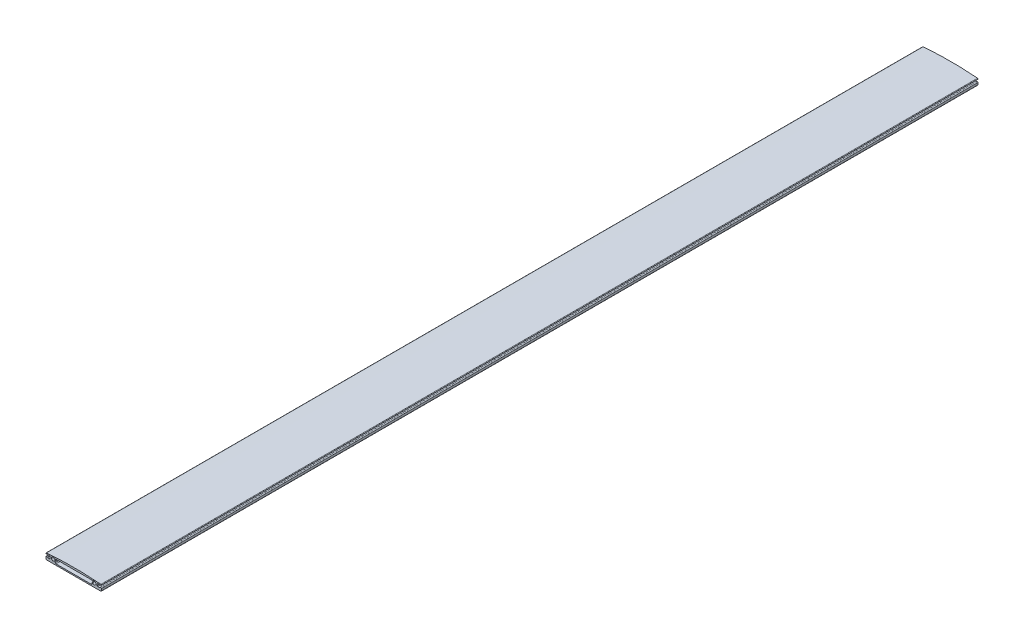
ISO-10303-21;
HEADER;
FILE_DESCRIPTION(('STEP AP214'),'2;1');
FILE_NAME('part.step','',(''),(''),'','','');
FILE_SCHEMA(('AUTOMOTIVE_DESIGN { 1 0 10303 214 1 1 1 1 }'));
ENDSEC;
DATA;
#1=APPLICATION_CONTEXT('core data for automotive mechanical design processes');
#2=APPLICATION_PROTOCOL_DEFINITION('international standard','automotive_design',2000,#1);
#3=PRODUCT_CONTEXT('',#1,'mechanical');
#4=PRODUCT('Part','Part','',(#3));
#5=PRODUCT_RELATED_PRODUCT_CATEGORY('part','',(#4));
#6=PRODUCT_DEFINITION_FORMATION('','',#4);
#7=PRODUCT_DEFINITION_CONTEXT('part definition',#1,'design');
#8=PRODUCT_DEFINITION('design','',#6,#7);
#9=PRODUCT_DEFINITION_SHAPE('','',#8);
#10=(LENGTH_UNIT() NAMED_UNIT(*) SI_UNIT(.MILLI.,.METRE.));
#11=(NAMED_UNIT(*) PLANE_ANGLE_UNIT() SI_UNIT($,.RADIAN.));
#12=(NAMED_UNIT(*) SI_UNIT($,.STERADIAN.) SOLID_ANGLE_UNIT());
#13=UNCERTAINTY_MEASURE_WITH_UNIT(LENGTH_MEASURE(1.E-05),#10,'distance_accuracy_value','');
#14=(GEOMETRIC_REPRESENTATION_CONTEXT(3) GLOBAL_UNCERTAINTY_ASSIGNED_CONTEXT((#13)) GLOBAL_UNIT_ASSIGNED_CONTEXT((#10,
#11,#12)) REPRESENTATION_CONTEXT('',''));
#15=CARTESIAN_POINT('',(0.,0.,0.));
#16=DIRECTION('',(0.,0.,1.));
#17=DIRECTION('',(1.,0.,0.));
#18=AXIS2_PLACEMENT_3D('',#15,#16,#17);
#19=CARTESIAN_POINT('',(24.4987244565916,-0.250000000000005,-522.65));
#20=DIRECTION('',(0.,0.,1.));
#21=DIRECTION('',(1.,0.,0.));
#22=AXIS2_PLACEMENT_3D('',#19,#20,#21);
#23=CYLINDRICAL_SURFACE('',#22,1.6);
#24=CARTESIAN_POINT('',(24.4987244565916,-0.250000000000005,-514.65));
#25=DIRECTION('',(0.,0.,-1.));
#26=DIRECTION('',(-1.,0.,0.));
#27=AXIS2_PLACEMENT_3D('',#24,#25,#26);
#28=CIRCLE('',#27,1.6);
#29=CARTESIAN_POINT('',(23.0853950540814,-1.,-514.65));
#30=VERTEX_POINT('',#29);
#31=CARTESIAN_POINT('',(23.0853950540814,0.499999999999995,-514.65));
#32=VERTEX_POINT('',#31);
#33=EDGE_CURVE('E626',#30,#32,#28,.F.);
#34=ORIENTED_EDGE('',*,*,#33,.F.);
#35=DIRECTION('',(0.,0.,1.));
#36=VECTOR('',#35,1.);
#37=CARTESIAN_POINT('',(23.0853950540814,-1.00000000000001,-522.65));
#38=LINE('',#37,#36);
#39=CARTESIAN_POINT('',(23.0853950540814,-1.00000000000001,512.519956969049));
#40=VERTEX_POINT('',#39);
#41=EDGE_CURVE('E345',#30,#40,#38,.T.);
#42=ORIENTED_EDGE('',*,*,#41,.T.);
#43=CARTESIAN_POINT('',(24.4987244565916,-0.250000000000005,512.519956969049));
#44=DIRECTION('',(0.,0.,1.));
#45=DIRECTION('',(1.,0.,0.));
#46=AXIS2_PLACEMENT_3D('',#43,#44,#45);
#47=CIRCLE('',#46,1.6);
#48=CARTESIAN_POINT('',(23.0853950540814,0.499999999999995,512.519956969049));
#49=VERTEX_POINT('',#48);
#50=EDGE_CURVE('E604',#40,#49,#47,.T.);
#51=ORIENTED_EDGE('',*,*,#50,.T.);
#52=DIRECTION('',(0.,0.,1.));
#53=VECTOR('',#52,1.);
#54=CARTESIAN_POINT('',(23.0853950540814,0.499999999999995,-522.65));
#55=LINE('',#54,#53);
#56=EDGE_CURVE('E358',#32,#49,#55,.T.);
#57=ORIENTED_EDGE('',*,*,#56,.F.);
#58=EDGE_LOOP('',(#34,#42,#51,#57));
#59=FACE_BOUND('',#58,.T.);
#60=ADVANCED_FACE('F16',(#59),#23,.F.);
#61=CARTESIAN_POINT('',(-24.4987244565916,-0.250000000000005,-522.65));
#62=DIRECTION('',(0.,0.,1.));
#63=DIRECTION('',(1.,0.,0.));
#64=AXIS2_PLACEMENT_3D('',#61,#62,#63);
#65=CYLINDRICAL_SURFACE('',#64,1.6);
#66=CARTESIAN_POINT('',(-24.4987244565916,-0.250000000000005,-514.65));
#67=DIRECTION('',(0.,0.,-1.));
#68=DIRECTION('',(-1.,0.,0.));
#69=AXIS2_PLACEMENT_3D('',#66,#67,#68);
#70=CIRCLE('',#69,1.6);
#71=CARTESIAN_POINT('',(-23.0853950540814,0.499999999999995,-514.65));
#72=VERTEX_POINT('',#71);
#73=CARTESIAN_POINT('',(-23.0853950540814,-1.,-514.65));
#74=VERTEX_POINT('',#73);
#75=EDGE_CURVE('E773',#72,#74,#70,.F.);
#76=ORIENTED_EDGE('',*,*,#75,.F.);
#77=DIRECTION('',(0.,0.,1.));
#78=VECTOR('',#77,1.);
#79=CARTESIAN_POINT('',(-23.0853950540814,0.499999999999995,-522.65));
#80=LINE('',#79,#78);
#81=CARTESIAN_POINT('',(-23.0853950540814,0.499999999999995,512.519956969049));
#82=VERTEX_POINT('',#81);
#83=EDGE_CURVE('E690',#72,#82,#80,.T.);
#84=ORIENTED_EDGE('',*,*,#83,.T.);
#85=CARTESIAN_POINT('',(-24.4987244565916,-0.250000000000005,512.519956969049));
#86=DIRECTION('',(0.,0.,1.));
#87=DIRECTION('',(1.,0.,0.));
#88=AXIS2_PLACEMENT_3D('',#85,#86,#87);
#89=CIRCLE('',#88,1.6);
#90=CARTESIAN_POINT('',(-23.0853950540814,-1.,512.519956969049));
#91=VERTEX_POINT('',#90);
#92=EDGE_CURVE('E708',#82,#91,#89,.T.);
#93=ORIENTED_EDGE('',*,*,#92,.T.);
#94=DIRECTION('',(0.,0.,1.));
#95=VECTOR('',#94,1.);
#96=CARTESIAN_POINT('',(-23.0853950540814,-1.,-522.65));
#97=LINE('',#96,#95);
#98=EDGE_CURVE('E692',#74,#91,#97,.T.);
#99=ORIENTED_EDGE('',*,*,#98,.F.);
#100=EDGE_LOOP('',(#76,#84,#93,#99));
#101=FACE_BOUND('',#100,.T.);
#102=ADVANCED_FACE('F616',(#101),#65,.F.);
#103=CARTESIAN_POINT('',(32.4,-4.4,522.65));
#104=DIRECTION('',(0.,0.,-1.));
#105=DIRECTION('',(-1.,0.,0.));
#106=AXIS2_PLACEMENT_3D('',#103,#104,#105);
#107=PLANE('',#106);
#108=DIRECTION('',(1.,0.,0.));
#109=VECTOR('',#108,1.);
#110=CARTESIAN_POINT('',(-22.,-5.,522.65));
#111=LINE('',#110,#109);
#112=CARTESIAN_POINT('',(-32.4,-5.,522.65));
#113=VERTEX_POINT('',#112);
#114=CARTESIAN_POINT('',(32.4,-5.00000000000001,522.65));
#115=VERTEX_POINT('',#114);
#116=EDGE_CURVE('E415',#113,#115,#111,.T.);
#117=ORIENTED_EDGE('',*,*,#116,.T.);
#118=CARTESIAN_POINT('',(32.4,-4.4,522.65));
#119=DIRECTION('',(0.,0.,1.));
#120=DIRECTION('',(-1.,0.,0.));
#121=AXIS2_PLACEMENT_3D('',#118,#119,#120);
#122=CIRCLE('',#121,0.600000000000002);
#123=CARTESIAN_POINT('',(33.,-4.4,522.65));
#124=VERTEX_POINT('',#123);
#125=EDGE_CURVE('E417',#115,#124,#122,.T.);
#126=ORIENTED_EDGE('',*,*,#125,.T.);
#127=DIRECTION('',(0.,1.,0.));
#128=VECTOR('',#127,1.);
#129=CARTESIAN_POINT('',(33.,-4.4,522.65));
#130=LINE('',#129,#128);
#131=CARTESIAN_POINT('',(33.,-2.,522.65));
#132=VERTEX_POINT('',#131);
#133=EDGE_CURVE('E420',#124,#132,#130,.T.);
#134=ORIENTED_EDGE('',*,*,#133,.T.);
#135=CARTESIAN_POINT('',(32.25,-2.,522.65));
#136=DIRECTION('',(0.,0.,1.));
#137=DIRECTION('',(-1.,0.,0.));
#138=AXIS2_PLACEMENT_3D('',#135,#136,#137);
#139=CIRCLE('',#138,0.75);
#140=CARTESIAN_POINT('',(31.5626136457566,-1.7,522.65));
#141=VERTEX_POINT('',#140);
#142=EDGE_CURVE('E422',#132,#141,#139,.T.);
#143=ORIENTED_EDGE('',*,*,#142,.T.);
#144=CARTESIAN_POINT('',(31.104356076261,-1.5,522.65));
#145=DIRECTION('',(0.,0.,-1.));
#146=DIRECTION('',(-1.,0.,0.));
#147=AXIS2_PLACEMENT_3D('',#144,#145,#146);
#148=CIRCLE('',#147,0.500000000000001);
#149=CARTESIAN_POINT('',(31.104356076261,-2.,522.65));
#150=VERTEX_POINT('',#149);
#151=EDGE_CURVE('E424',#141,#150,#148,.T.);
#152=ORIENTED_EDGE('',*,*,#151,.T.);
#153=DIRECTION('',(-1.,0.,0.));
#154=VECTOR('',#153,1.);
#155=CARTESIAN_POINT('',(31.104356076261,-2.,522.65));
#156=LINE('',#155,#154);
#157=CARTESIAN_POINT('',(28.6,-2.,522.65));
#158=VERTEX_POINT('',#157);
#159=EDGE_CURVE('E426',#150,#158,#156,.T.);
#160=ORIENTED_EDGE('',*,*,#159,.T.);
#161=CARTESIAN_POINT('',(28.6,-1.4,522.65));
#162=DIRECTION('',(0.,0.,-1.));
#163=DIRECTION('',(1.,0.,0.));
#164=AXIS2_PLACEMENT_3D('',#161,#162,#163);
#165=CIRCLE('',#164,0.6);
#166=CARTESIAN_POINT('',(28.,-1.4,522.65));
#167=VERTEX_POINT('',#166);
#168=EDGE_CURVE('E428',#158,#167,#165,.T.);
#169=ORIENTED_EDGE('',*,*,#168,.T.);
#170=DIRECTION('',(0.,1.,0.));
#171=VECTOR('',#170,1.);
#172=CARTESIAN_POINT('',(28.,0.149999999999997,522.65));
#173=LINE('',#172,#171);
#174=CARTESIAN_POINT('',(28.,0.149999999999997,522.65));
#175=VERTEX_POINT('',#174);
#176=EDGE_CURVE('E430',#167,#175,#173,.T.);
#177=ORIENTED_EDGE('',*,*,#176,.T.);
#178=CARTESIAN_POINT('',(28.85,0.149999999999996,522.65));
#179=DIRECTION('',(0.,0.,-1.));
#180=DIRECTION('',(-1.,0.,0.));
#181=AXIS2_PLACEMENT_3D('',#178,#179,#180);
#182=CIRCLE('',#181,0.850000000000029);
#183=CARTESIAN_POINT('',(28.85,0.999999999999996,522.65));
#184=VERTEX_POINT('',#183);
#185=EDGE_CURVE('E432',#175,#184,#182,.T.);
#186=ORIENTED_EDGE('',*,*,#185,.T.);
#187=DIRECTION('',(1.,0.,0.));
#188=VECTOR('',#187,1.);
#189=CARTESIAN_POINT('',(32.3999999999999,0.999999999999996,522.65));
#190=LINE('',#189,#188);
#191=CARTESIAN_POINT('',(32.3999999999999,0.999999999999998,522.65));
#192=VERTEX_POINT('',#191);
#193=EDGE_CURVE('E434',#184,#192,#190,.T.);
#194=ORIENTED_EDGE('',*,*,#193,.T.);
#195=CARTESIAN_POINT('',(32.4,1.60048941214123,522.65));
#196=DIRECTION('',(0.,0.,1.));
#197=DIRECTION('',(1.,0.,0.));
#198=AXIS2_PLACEMENT_3D('',#195,#196,#197);
#199=CIRCLE('',#198,0.600489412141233);
#200=CARTESIAN_POINT('',(32.4484386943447,2.19902197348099,522.65));
#201=VERTEX_POINT('',#200);
#202=EDGE_CURVE('E436',#192,#201,#199,.T.);
#203=ORIENTED_EDGE('',*,*,#202,.T.);
#204=CARTESIAN_POINT('',(0.,-398.75,522.65));
#205=DIRECTION('',(0.,0.,1.));
#206=DIRECTION('',(-1.,0.,0.));
#207=AXIS2_PLACEMENT_3D('',#204,#205,#206);
#208=CIRCLE('',#207,402.259890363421);
#209=CARTESIAN_POINT('',(-32.4484386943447,2.19902197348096,522.65));
#210=VERTEX_POINT('',#209);
#211=EDGE_CURVE('E438',#201,#210,#208,.T.);
#212=ORIENTED_EDGE('',*,*,#211,.T.);
#213=CARTESIAN_POINT('',(-32.4,1.60048941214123,522.65));
#214=DIRECTION('',(0.,0.,1.));
#215=DIRECTION('',(-1.,0.,0.));
#216=AXIS2_PLACEMENT_3D('',#213,#214,#215);
#217=CIRCLE('',#216,0.600489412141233);
#218=CARTESIAN_POINT('',(-32.3999999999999,0.999999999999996,522.65));
#219=VERTEX_POINT('',#218);
#220=EDGE_CURVE('E440',#210,#219,#217,.T.);
#221=ORIENTED_EDGE('',*,*,#220,.T.);
#222=DIRECTION('',(1.,0.,0.));
#223=VECTOR('',#222,1.);
#224=CARTESIAN_POINT('',(-32.3999999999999,0.999999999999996,522.65));
#225=LINE('',#224,#223);
#226=CARTESIAN_POINT('',(-28.85,1.00000000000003,522.65));
#227=VERTEX_POINT('',#226);
#228=EDGE_CURVE('E442',#219,#227,#225,.T.);
#229=ORIENTED_EDGE('',*,*,#228,.T.);
#230=CARTESIAN_POINT('',(-28.85,0.149999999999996,522.65));
#231=DIRECTION('',(0.,0.,-1.));
#232=DIRECTION('',(1.,0.,0.));
#233=AXIS2_PLACEMENT_3D('',#230,#231,#232);
#234=CIRCLE('',#233,0.850000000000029);
#235=CARTESIAN_POINT('',(-28.,0.149999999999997,522.65));
#236=VERTEX_POINT('',#235);
#237=EDGE_CURVE('E444',#227,#236,#234,.T.);
#238=ORIENTED_EDGE('',*,*,#237,.T.);
#239=DIRECTION('',(0.,-1.,0.));
#240=VECTOR('',#239,1.);
#241=CARTESIAN_POINT('',(-28.,0.149999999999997,522.65));
#242=LINE('',#241,#240);
#243=CARTESIAN_POINT('',(-28.,-1.4,522.65));
#244=VERTEX_POINT('',#243);
#245=EDGE_CURVE('E446',#236,#244,#242,.T.);
#246=ORIENTED_EDGE('',*,*,#245,.T.);
#247=CARTESIAN_POINT('',(-28.6,-1.4,522.65));
#248=DIRECTION('',(0.,0.,-1.));
#249=DIRECTION('',(-1.,0.,0.));
#250=AXIS2_PLACEMENT_3D('',#247,#248,#249);
#251=CIRCLE('',#250,0.6);
#252=CARTESIAN_POINT('',(-28.6,-2.,522.65));
#253=VERTEX_POINT('',#252);
#254=EDGE_CURVE('E448',#244,#253,#251,.T.);
#255=ORIENTED_EDGE('',*,*,#254,.T.);
#256=DIRECTION('',(-1.,0.,0.));
#257=VECTOR('',#256,1.);
#258=CARTESIAN_POINT('',(-31.104356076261,-2.,522.65));
#259=LINE('',#258,#257);
#260=CARTESIAN_POINT('',(-31.104356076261,-2.,522.65));
#261=VERTEX_POINT('',#260);
#262=EDGE_CURVE('E450',#253,#261,#259,.T.);
#263=ORIENTED_EDGE('',*,*,#262,.T.);
#264=CARTESIAN_POINT('',(-31.104356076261,-1.5,522.65));
#265=DIRECTION('',(0.,0.,-1.));
#266=DIRECTION('',(1.,0.,0.));
#267=AXIS2_PLACEMENT_3D('',#264,#265,#266);
#268=CIRCLE('',#267,0.500000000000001);
#269=CARTESIAN_POINT('',(-31.5626136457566,-1.7,522.65));
#270=VERTEX_POINT('',#269);
#271=EDGE_CURVE('E452',#261,#270,#268,.T.);
#272=ORIENTED_EDGE('',*,*,#271,.T.);
#273=CARTESIAN_POINT('',(-32.25,-2.,522.65));
#274=DIRECTION('',(0.,0.,1.));
#275=DIRECTION('',(1.,0.,0.));
#276=AXIS2_PLACEMENT_3D('',#273,#274,#275);
#277=CIRCLE('',#276,0.75);
#278=CARTESIAN_POINT('',(-33.,-2.,522.65));
#279=VERTEX_POINT('',#278);
#280=EDGE_CURVE('E454',#270,#279,#277,.T.);
#281=ORIENTED_EDGE('',*,*,#280,.T.);
#282=DIRECTION('',(0.,-1.,0.));
#283=VECTOR('',#282,1.);
#284=CARTESIAN_POINT('',(-33.,-4.4,522.65));
#285=LINE('',#284,#283);
#286=CARTESIAN_POINT('',(-33.,-4.4,522.65));
#287=VERTEX_POINT('',#286);
#288=EDGE_CURVE('E456',#279,#287,#285,.T.);
#289=ORIENTED_EDGE('',*,*,#288,.T.);
#290=CARTESIAN_POINT('',(-32.4,-4.4,522.65));
#291=DIRECTION('',(0.,0.,1.));
#292=DIRECTION('',(1.,0.,0.));
#293=AXIS2_PLACEMENT_3D('',#290,#291,#292);
#294=CIRCLE('',#293,0.600000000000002);
#295=EDGE_CURVE('E458',#287,#113,#294,.T.);
#296=ORIENTED_EDGE('',*,*,#295,.T.);
#297=EDGE_LOOP('',(#117,#126,#134,#143,#152,#160,#169,#177,#186,#194,#203,#212,#221,#229,#238,
#246,#255,#263,#272,#281,#289,#296));
#298=FACE_BOUND('',#297,.T.);
#299=DIRECTION('',(1.,0.,0.));
#300=VECTOR('',#299,1.);
#301=CARTESIAN_POINT('',(-23.0853950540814,-1.,522.65));
#302=LINE('',#301,#300);
#303=CARTESIAN_POINT('',(-22.6446748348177,-1.,522.65));
#304=VERTEX_POINT('',#303);
#305=CARTESIAN_POINT('',(-22.,-1.,522.65));
#306=VERTEX_POINT('',#305);
#307=EDGE_CURVE('E698',#304,#306,#302,.T.);
#308=ORIENTED_EDGE('',*,*,#307,.F.);
#309=CARTESIAN_POINT('',(-24.4987244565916,-0.250000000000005,522.65));
#310=DIRECTION('',(0.,0.,1.));
#311=DIRECTION('',(1.,0.,0.));
#312=AXIS2_PLACEMENT_3D('',#309,#310,#311);
#313=CIRCLE('',#312,1.99999999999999);
#314=CARTESIAN_POINT('',(-22.6446748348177,0.499999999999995,522.65));
#315=VERTEX_POINT('',#314);
#316=EDGE_CURVE('E705',#315,#304,#313,.T.);
#317=ORIENTED_EDGE('',*,*,#316,.F.);
#318=DIRECTION('',(-1.,0.,0.));
#319=VECTOR('',#318,1.);
#320=CARTESIAN_POINT('',(-23.0853950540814,0.499999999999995,522.65));
#321=LINE('',#320,#319);
#322=CARTESIAN_POINT('',(-21.9682458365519,0.499999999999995,522.65));
#323=VERTEX_POINT('',#322);
#324=EDGE_CURVE('E603',#323,#315,#321,.T.);
#325=ORIENTED_EDGE('',*,*,#324,.F.);
#326=CARTESIAN_POINT('',(-21.,0.249999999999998,522.65));
#327=DIRECTION('',(0.,0.,1.));
#328=DIRECTION('',(-1.,0.,0.));
#329=AXIS2_PLACEMENT_3D('',#326,#327,#328);
#330=CIRCLE('',#329,1.);
#331=CARTESIAN_POINT('',(-21.,1.25,522.65));
#332=VERTEX_POINT('',#331);
#333=EDGE_CURVE('E361',#332,#323,#330,.T.);
#334=ORIENTED_EDGE('',*,*,#333,.F.);
#335=DIRECTION('',(-1.,0.,0.));
#336=VECTOR('',#335,1.);
#337=CARTESIAN_POINT('',(-21.,1.25,522.65));
#338=LINE('',#337,#336);
#339=CARTESIAN_POINT('',(21.,1.25,522.65));
#340=VERTEX_POINT('',#339);
#341=EDGE_CURVE('E378',#340,#332,#338,.T.);
#342=ORIENTED_EDGE('',*,*,#341,.F.);
#343=CARTESIAN_POINT('',(21.,0.249999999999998,522.65));
#344=DIRECTION('',(0.,0.,1.));
#345=DIRECTION('',(1.,0.,0.));
#346=AXIS2_PLACEMENT_3D('',#343,#344,#345);
#347=CIRCLE('',#346,1.);
#348=CARTESIAN_POINT('',(21.9682458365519,0.499999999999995,522.65));
#349=VERTEX_POINT('',#348);
#350=EDGE_CURVE('E376',#349,#340,#347,.T.);
#351=ORIENTED_EDGE('',*,*,#350,.F.);
#352=DIRECTION('',(-1.,0.,0.));
#353=VECTOR('',#352,1.);
#354=CARTESIAN_POINT('',(23.0853950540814,0.499999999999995,522.65));
#355=LINE('',#354,#353);
#356=CARTESIAN_POINT('',(22.6446748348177,0.499999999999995,522.65));
#357=VERTEX_POINT('',#356);
#358=EDGE_CURVE('E347',#357,#349,#355,.T.);
#359=ORIENTED_EDGE('',*,*,#358,.F.);
#360=CARTESIAN_POINT('',(24.4987244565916,-0.250000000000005,522.65));
#361=DIRECTION('',(0.,0.,1.));
#362=DIRECTION('',(1.,0.,0.));
#363=AXIS2_PLACEMENT_3D('',#360,#361,#362);
#364=CIRCLE('',#363,1.99999999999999);
#365=CARTESIAN_POINT('',(22.6446748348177,-1.,522.65));
#366=VERTEX_POINT('',#365);
#367=EDGE_CURVE('E655',#366,#357,#364,.T.);
#368=ORIENTED_EDGE('',*,*,#367,.F.);
#369=DIRECTION('',(1.,0.,0.));
#370=VECTOR('',#369,1.);
#371=CARTESIAN_POINT('',(23.0853950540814,-1.,522.65));
#372=LINE('',#371,#370);
#373=CARTESIAN_POINT('',(22.,-1.,522.65));
#374=VERTEX_POINT('',#373);
#375=EDGE_CURVE('E351',#374,#366,#372,.T.);
#376=ORIENTED_EDGE('',*,*,#375,.F.);
#377=DIRECTION('',(0.,1.,0.));
#378=VECTOR('',#377,1.);
#379=CARTESIAN_POINT('',(22.,-2.5,522.65));
#380=LINE('',#379,#378);
#381=CARTESIAN_POINT('',(22.,-2.5,522.65));
#382=VERTEX_POINT('',#381);
#383=EDGE_CURVE('E373',#382,#374,#380,.T.);
#384=ORIENTED_EDGE('',*,*,#383,.F.);
#385=CARTESIAN_POINT('',(21.,-2.5,522.65));
#386=DIRECTION('',(0.,0.,1.));
#387=DIRECTION('',(-1.,0.,0.));
#388=AXIS2_PLACEMENT_3D('',#385,#386,#387);
#389=CIRCLE('',#388,1.);
#390=CARTESIAN_POINT('',(21.,-3.5,522.65));
#391=VERTEX_POINT('',#390);
#392=EDGE_CURVE('E371',#391,#382,#389,.T.);
#393=ORIENTED_EDGE('',*,*,#392,.F.);
#394=DIRECTION('',(1.,0.,0.));
#395=VECTOR('',#394,1.);
#396=CARTESIAN_POINT('',(21.,-3.5,522.65));
#397=LINE('',#396,#395);
#398=CARTESIAN_POINT('',(-21.,-3.50000000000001,522.65));
#399=VERTEX_POINT('',#398);
#400=EDGE_CURVE('E369',#399,#391,#397,.T.);
#401=ORIENTED_EDGE('',*,*,#400,.F.);
#402=CARTESIAN_POINT('',(-21.,-2.50000000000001,522.65));
#403=DIRECTION('',(0.,0.,1.));
#404=DIRECTION('',(-1.,0.,0.));
#405=AXIS2_PLACEMENT_3D('',#402,#403,#404);
#406=CIRCLE('',#405,1.);
#407=CARTESIAN_POINT('',(-22.,-2.50000000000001,522.65));
#408=VERTEX_POINT('',#407);
#409=EDGE_CURVE('E367',#408,#399,#406,.T.);
#410=ORIENTED_EDGE('',*,*,#409,.F.);
#411=DIRECTION('',(0.,-1.,0.));
#412=VECTOR('',#411,1.);
#413=CARTESIAN_POINT('',(-22.,-2.50000000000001,522.65));
#414=LINE('',#413,#412);
#415=EDGE_CURVE('E364',#306,#408,#414,.T.);
#416=ORIENTED_EDGE('',*,*,#415,.F.);
#417=EDGE_LOOP('',(#308,#317,#325,#334,#342,#351,#359,#368,#376,#384,#393,#401,#410,#416));
#418=FACE_BOUND('',#417,.T.);
#419=ADVANCED_FACE('F622',(#298,#418),#107,.F.);
#420=CARTESIAN_POINT('',(32.4,-4.4,-522.65));
#421=DIRECTION('',(0.,0.,-1.));
#422=DIRECTION('',(-1.,0.,0.));
#423=AXIS2_PLACEMENT_3D('',#420,#421,#422);
#424=PLANE('',#423);
#425=CARTESIAN_POINT('',(24.4987244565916,-0.250000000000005,-522.65));
#426=DIRECTION('',(0.,0.,-1.));
#427=DIRECTION('',(-1.,0.,0.));
#428=AXIS2_PLACEMENT_3D('',#425,#426,#427);
#429=CIRCLE('',#428,2.);
#430=CARTESIAN_POINT('',(22.6446748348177,0.499999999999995,-522.65));
#431=VERTEX_POINT('',#430);
#432=CARTESIAN_POINT('',(22.6446748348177,-1.,-522.65));
#433=VERTEX_POINT('',#432);
#434=EDGE_CURVE('E323',#431,#433,#429,.T.);
#435=ORIENTED_EDGE('',*,*,#434,.F.);
#436=DIRECTION('',(-1.,0.,0.));
#437=VECTOR('',#436,1.);
#438=CARTESIAN_POINT('',(23.0853950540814,0.499999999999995,-522.65));
#439=LINE('',#438,#437);
#440=CARTESIAN_POINT('',(21.9682458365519,0.499999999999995,-522.65));
#441=VERTEX_POINT('',#440);
#442=EDGE_CURVE('E334',#431,#441,#439,.T.);
#443=ORIENTED_EDGE('',*,*,#442,.T.);
#444=CARTESIAN_POINT('',(21.,0.249999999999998,-522.65));
#445=DIRECTION('',(0.,0.,1.));
#446=DIRECTION('',(1.,0.,0.));
#447=AXIS2_PLACEMENT_3D('',#444,#445,#446);
#448=CIRCLE('',#447,1.);
#449=CARTESIAN_POINT('',(21.,1.25,-522.65));
#450=VERTEX_POINT('',#449);
#451=EDGE_CURVE('E396',#441,#450,#448,.T.);
#452=ORIENTED_EDGE('',*,*,#451,.T.);
#453=DIRECTION('',(-1.,0.,0.));
#454=VECTOR('',#453,1.);
#455=CARTESIAN_POINT('',(-21.,1.25,-522.65));
#456=LINE('',#455,#454);
#457=CARTESIAN_POINT('',(-21.,1.25,-522.65));
#458=VERTEX_POINT('',#457);
#459=EDGE_CURVE('E365',#450,#458,#456,.T.);
#460=ORIENTED_EDGE('',*,*,#459,.T.);
#461=CARTESIAN_POINT('',(-21.,0.249999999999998,-522.65));
#462=DIRECTION('',(0.,0.,1.));
#463=DIRECTION('',(-1.,0.,0.));
#464=AXIS2_PLACEMENT_3D('',#461,#462,#463);
#465=CIRCLE('',#464,1.);
#466=CARTESIAN_POINT('',(-21.9682458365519,0.499999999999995,-522.65));
#467=VERTEX_POINT('',#466);
#468=EDGE_CURVE('E357',#458,#467,#465,.T.);
#469=ORIENTED_EDGE('',*,*,#468,.T.);
#470=DIRECTION('',(-1.,0.,0.));
#471=VECTOR('',#470,1.);
#472=CARTESIAN_POINT('',(-23.0853950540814,0.499999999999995,-522.65));
#473=LINE('',#472,#471);
#474=CARTESIAN_POINT('',(-22.6446748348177,0.499999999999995,-522.65));
#475=VERTEX_POINT('',#474);
#476=EDGE_CURVE('E606',#467,#475,#473,.T.);
#477=ORIENTED_EDGE('',*,*,#476,.T.);
#478=CARTESIAN_POINT('',(-24.4987244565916,-0.250000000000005,-522.65));
#479=DIRECTION('',(0.,0.,-1.));
#480=DIRECTION('',(-1.,0.,0.));
#481=AXIS2_PLACEMENT_3D('',#478,#479,#480);
#482=CIRCLE('',#481,2.);
#483=CARTESIAN_POINT('',(-22.6446748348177,-1.,-522.65));
#484=VERTEX_POINT('',#483);
#485=EDGE_CURVE('E327',#484,#475,#482,.T.);
#486=ORIENTED_EDGE('',*,*,#485,.F.);
#487=DIRECTION('',(1.,0.,0.));
#488=VECTOR('',#487,1.);
#489=CARTESIAN_POINT('',(-23.0853950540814,-1.,-522.65));
#490=LINE('',#489,#488);
#491=CARTESIAN_POINT('',(-22.,-1.,-522.65));
#492=VERTEX_POINT('',#491);
#493=EDGE_CURVE('E691',#484,#492,#490,.T.);
#494=ORIENTED_EDGE('',*,*,#493,.T.);
#495=DIRECTION('',(0.,-1.,0.));
#496=VECTOR('',#495,1.);
#497=CARTESIAN_POINT('',(-22.,-2.50000000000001,-522.65));
#498=LINE('',#497,#496);
#499=CARTESIAN_POINT('',(-22.,-2.50000000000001,-522.65));
#500=VERTEX_POINT('',#499);
#501=EDGE_CURVE('E383',#492,#500,#498,.T.);
#502=ORIENTED_EDGE('',*,*,#501,.T.);
#503=CARTESIAN_POINT('',(-21.,-2.50000000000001,-522.65));
#504=DIRECTION('',(0.,0.,1.));
#505=DIRECTION('',(-1.,0.,0.));
#506=AXIS2_PLACEMENT_3D('',#503,#504,#505);
#507=CIRCLE('',#506,1.);
#508=CARTESIAN_POINT('',(-21.,-3.50000000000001,-522.65));
#509=VERTEX_POINT('',#508);
#510=EDGE_CURVE('E385',#500,#509,#507,.T.);
#511=ORIENTED_EDGE('',*,*,#510,.T.);
#512=DIRECTION('',(1.,0.,0.));
#513=VECTOR('',#512,1.);
#514=CARTESIAN_POINT('',(21.,-3.5,-522.65));
#515=LINE('',#514,#513);
#516=CARTESIAN_POINT('',(21.,-3.5,-522.65));
#517=VERTEX_POINT('',#516);
#518=EDGE_CURVE('E388',#509,#517,#515,.T.);
#519=ORIENTED_EDGE('',*,*,#518,.T.);
#520=CARTESIAN_POINT('',(21.,-2.5,-522.65));
#521=DIRECTION('',(0.,0.,1.));
#522=DIRECTION('',(-1.,0.,0.));
#523=AXIS2_PLACEMENT_3D('',#520,#521,#522);
#524=CIRCLE('',#523,1.);
#525=CARTESIAN_POINT('',(22.,-2.5,-522.65));
#526=VERTEX_POINT('',#525);
#527=EDGE_CURVE('E391',#517,#526,#524,.T.);
#528=ORIENTED_EDGE('',*,*,#527,.T.);
#529=DIRECTION('',(0.,1.,0.));
#530=VECTOR('',#529,1.);
#531=CARTESIAN_POINT('',(22.,-2.5,-522.65));
#532=LINE('',#531,#530);
#533=CARTESIAN_POINT('',(22.,-1.,-522.65));
#534=VERTEX_POINT('',#533);
#535=EDGE_CURVE('E394',#526,#534,#532,.T.);
#536=ORIENTED_EDGE('',*,*,#535,.T.);
#537=DIRECTION('',(1.,0.,0.));
#538=VECTOR('',#537,1.);
#539=CARTESIAN_POINT('',(23.0853950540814,-1.,-522.65));
#540=LINE('',#539,#538);
#541=EDGE_CURVE('E337',#534,#433,#540,.T.);
#542=ORIENTED_EDGE('',*,*,#541,.T.);
#543=EDGE_LOOP('',(#435,#443,#452,#460,#469,#477,#486,#494,#502,#511,#519,#528,#536,#542));
#544=FACE_BOUND('',#543,.T.);
#545=CARTESIAN_POINT('',(32.4,-4.4,-522.65));
#546=DIRECTION('',(0.,0.,1.));
#547=DIRECTION('',(-1.,0.,0.));
#548=AXIS2_PLACEMENT_3D('',#545,#546,#547);
#549=CIRCLE('',#548,0.600000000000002);
#550=CARTESIAN_POINT('',(32.4,-5.00000000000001,-522.65));
#551=VERTEX_POINT('',#550);
#552=CARTESIAN_POINT('',(33.,-4.4,-522.65));
#553=VERTEX_POINT('',#552);
#554=EDGE_CURVE('E414',#551,#553,#549,.T.);
#555=ORIENTED_EDGE('',*,*,#554,.F.);
#556=DIRECTION('',(1.,0.,0.));
#557=VECTOR('',#556,1.);
#558=CARTESIAN_POINT('',(-22.,-5.,-522.65));
#559=LINE('',#558,#557);
#560=CARTESIAN_POINT('',(-32.4,-5.,-522.65));
#561=VERTEX_POINT('',#560);
#562=EDGE_CURVE('E418',#561,#551,#559,.T.);
#563=ORIENTED_EDGE('',*,*,#562,.F.);
#564=CARTESIAN_POINT('',(-32.4,-4.4,-522.65));
#565=DIRECTION('',(0.,0.,1.));
#566=DIRECTION('',(1.,0.,0.));
#567=AXIS2_PLACEMENT_3D('',#564,#565,#566);
#568=CIRCLE('',#567,0.600000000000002);
#569=CARTESIAN_POINT('',(-33.,-4.4,-522.65));
#570=VERTEX_POINT('',#569);
#571=EDGE_CURVE('E501',#570,#561,#568,.T.);
#572=ORIENTED_EDGE('',*,*,#571,.F.);
#573=DIRECTION('',(0.,-1.,0.));
#574=VECTOR('',#573,1.);
#575=CARTESIAN_POINT('',(-33.,-4.4,-522.65));
#576=LINE('',#575,#574);
#577=CARTESIAN_POINT('',(-33.,-2.,-522.65));
#578=VERTEX_POINT('',#577);
#579=EDGE_CURVE('E499',#578,#570,#576,.T.);
#580=ORIENTED_EDGE('',*,*,#579,.F.);
#581=CARTESIAN_POINT('',(-32.25,-2.,-522.65));
#582=DIRECTION('',(0.,0.,1.));
#583=DIRECTION('',(1.,0.,0.));
#584=AXIS2_PLACEMENT_3D('',#581,#582,#583);
#585=CIRCLE('',#584,0.75);
#586=CARTESIAN_POINT('',(-31.5626136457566,-1.7,-522.65));
#587=VERTEX_POINT('',#586);
#588=EDGE_CURVE('E497',#587,#578,#585,.T.);
#589=ORIENTED_EDGE('',*,*,#588,.F.);
#590=CARTESIAN_POINT('',(-31.104356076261,-1.5,-522.65));
#591=DIRECTION('',(0.,0.,-1.));
#592=DIRECTION('',(1.,0.,0.));
#593=AXIS2_PLACEMENT_3D('',#590,#591,#592);
#594=CIRCLE('',#593,0.500000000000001);
#595=CARTESIAN_POINT('',(-31.104356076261,-2.,-522.65));
#596=VERTEX_POINT('',#595);
#597=EDGE_CURVE('E495',#596,#587,#594,.T.);
#598=ORIENTED_EDGE('',*,*,#597,.F.);
#599=DIRECTION('',(-1.,0.,0.));
#600=VECTOR('',#599,1.);
#601=CARTESIAN_POINT('',(-31.104356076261,-2.,-522.65));
#602=LINE('',#601,#600);
#603=CARTESIAN_POINT('',(-28.6,-2.,-522.65));
#604=VERTEX_POINT('',#603);
#605=EDGE_CURVE('E493',#604,#596,#602,.T.);
#606=ORIENTED_EDGE('',*,*,#605,.F.);
#607=CARTESIAN_POINT('',(-28.6,-1.4,-522.65));
#608=DIRECTION('',(0.,0.,-1.));
#609=DIRECTION('',(-1.,0.,0.));
#610=AXIS2_PLACEMENT_3D('',#607,#608,#609);
#611=CIRCLE('',#610,0.6);
#612=CARTESIAN_POINT('',(-28.,-1.4,-522.65));
#613=VERTEX_POINT('',#612);
#614=EDGE_CURVE('E491',#613,#604,#611,.T.);
#615=ORIENTED_EDGE('',*,*,#614,.F.);
#616=DIRECTION('',(0.,-1.,0.));
#617=VECTOR('',#616,1.);
#618=CARTESIAN_POINT('',(-28.,0.149999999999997,-522.65));
#619=LINE('',#618,#617);
#620=CARTESIAN_POINT('',(-28.,0.149999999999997,-522.65));
#621=VERTEX_POINT('',#620);
#622=EDGE_CURVE('E489',#621,#613,#619,.T.);
#623=ORIENTED_EDGE('',*,*,#622,.F.);
#624=CARTESIAN_POINT('',(-28.85,0.149999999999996,-522.65));
#625=DIRECTION('',(0.,0.,-1.));
#626=DIRECTION('',(1.,0.,0.));
#627=AXIS2_PLACEMENT_3D('',#624,#625,#626);
#628=CIRCLE('',#627,0.850000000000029);
#629=CARTESIAN_POINT('',(-28.85,1.00000000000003,-522.65));
#630=VERTEX_POINT('',#629);
#631=EDGE_CURVE('E487',#630,#621,#628,.T.);
#632=ORIENTED_EDGE('',*,*,#631,.F.);
#633=DIRECTION('',(1.,0.,0.));
#634=VECTOR('',#633,1.);
#635=CARTESIAN_POINT('',(-32.3999999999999,0.999999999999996,-522.65));
#636=LINE('',#635,#634);
#637=CARTESIAN_POINT('',(-32.3999999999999,0.999999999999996,-522.65));
#638=VERTEX_POINT('',#637);
#639=EDGE_CURVE('E485',#638,#630,#636,.T.);
#640=ORIENTED_EDGE('',*,*,#639,.F.);
#641=CARTESIAN_POINT('',(-32.4,1.60048941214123,-522.65));
#642=DIRECTION('',(0.,0.,1.));
#643=DIRECTION('',(-1.,0.,0.));
#644=AXIS2_PLACEMENT_3D('',#641,#642,#643);
#645=CIRCLE('',#644,0.600489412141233);
#646=CARTESIAN_POINT('',(-32.4484386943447,2.19902197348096,-522.65));
#647=VERTEX_POINT('',#646);
#648=EDGE_CURVE('E483',#647,#638,#645,.T.);
#649=ORIENTED_EDGE('',*,*,#648,.F.);
#650=CARTESIAN_POINT('',(0.,-398.75,-522.65));
#651=DIRECTION('',(0.,0.,1.));
#652=DIRECTION('',(-1.,0.,0.));
#653=AXIS2_PLACEMENT_3D('',#650,#651,#652);
#654=CIRCLE('',#653,402.259890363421);
#655=CARTESIAN_POINT('',(32.4484386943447,2.19902197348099,-522.65));
#656=VERTEX_POINT('',#655);
#657=EDGE_CURVE('E481',#656,#647,#654,.T.);
#658=ORIENTED_EDGE('',*,*,#657,.F.);
#659=CARTESIAN_POINT('',(32.4,1.60048941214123,-522.65));
#660=DIRECTION('',(0.,0.,1.));
#661=DIRECTION('',(1.,0.,0.));
#662=AXIS2_PLACEMENT_3D('',#659,#660,#661);
#663=CIRCLE('',#662,0.600489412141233);
#664=CARTESIAN_POINT('',(32.3999999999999,0.999999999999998,-522.65));
#665=VERTEX_POINT('',#664);
#666=EDGE_CURVE('E479',#665,#656,#663,.T.);
#667=ORIENTED_EDGE('',*,*,#666,.F.);
#668=DIRECTION('',(1.,0.,0.));
#669=VECTOR('',#668,1.);
#670=CARTESIAN_POINT('',(32.3999999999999,0.999999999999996,-522.65));
#671=LINE('',#670,#669);
#672=CARTESIAN_POINT('',(28.85,0.999999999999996,-522.65));
#673=VERTEX_POINT('',#672);
#674=EDGE_CURVE('E477',#673,#665,#671,.T.);
#675=ORIENTED_EDGE('',*,*,#674,.F.);
#676=CARTESIAN_POINT('',(28.85,0.149999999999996,-522.65));
#677=DIRECTION('',(0.,0.,-1.));
#678=DIRECTION('',(-1.,0.,0.));
#679=AXIS2_PLACEMENT_3D('',#676,#677,#678);
#680=CIRCLE('',#679,0.850000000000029);
#681=CARTESIAN_POINT('',(28.,0.149999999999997,-522.65));
#682=VERTEX_POINT('',#681);
#683=EDGE_CURVE('E475',#682,#673,#680,.T.);
#684=ORIENTED_EDGE('',*,*,#683,.F.);
#685=DIRECTION('',(0.,1.,0.));
#686=VECTOR('',#685,1.);
#687=CARTESIAN_POINT('',(28.,0.149999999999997,-522.65));
#688=LINE('',#687,#686);
#689=CARTESIAN_POINT('',(28.,-1.4,-522.65));
#690=VERTEX_POINT('',#689);
#691=EDGE_CURVE('E473',#690,#682,#688,.T.);
#692=ORIENTED_EDGE('',*,*,#691,.F.);
#693=CARTESIAN_POINT('',(28.6,-1.4,-522.65));
#694=DIRECTION('',(0.,0.,-1.));
#695=DIRECTION('',(1.,0.,0.));
#696=AXIS2_PLACEMENT_3D('',#693,#694,#695);
#697=CIRCLE('',#696,0.6);
#698=CARTESIAN_POINT('',(28.6,-2.,-522.65));
#699=VERTEX_POINT('',#698);
#700=EDGE_CURVE('E471',#699,#690,#697,.T.);
#701=ORIENTED_EDGE('',*,*,#700,.F.);
#702=DIRECTION('',(-1.,0.,0.));
#703=VECTOR('',#702,1.);
#704=CARTESIAN_POINT('',(31.104356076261,-2.,-522.65));
#705=LINE('',#704,#703);
#706=CARTESIAN_POINT('',(31.104356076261,-2.,-522.65));
#707=VERTEX_POINT('',#706);
#708=EDGE_CURVE('E469',#707,#699,#705,.T.);
#709=ORIENTED_EDGE('',*,*,#708,.F.);
#710=CARTESIAN_POINT('',(31.104356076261,-1.5,-522.65));
#711=DIRECTION('',(0.,0.,-1.));
#712=DIRECTION('',(-1.,0.,0.));
#713=AXIS2_PLACEMENT_3D('',#710,#711,#712);
#714=CIRCLE('',#713,0.500000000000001);
#715=CARTESIAN_POINT('',(31.5626136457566,-1.7,-522.65));
#716=VERTEX_POINT('',#715);
#717=EDGE_CURVE('E467',#716,#707,#714,.T.);
#718=ORIENTED_EDGE('',*,*,#717,.F.);
#719=CARTESIAN_POINT('',(32.25,-2.,-522.65));
#720=DIRECTION('',(0.,0.,1.));
#721=DIRECTION('',(-1.,0.,0.));
#722=AXIS2_PLACEMENT_3D('',#719,#720,#721);
#723=CIRCLE('',#722,0.75);
#724=CARTESIAN_POINT('',(33.,-2.,-522.65));
#725=VERTEX_POINT('',#724);
#726=EDGE_CURVE('E465',#725,#716,#723,.T.);
#727=ORIENTED_EDGE('',*,*,#726,.F.);
#728=DIRECTION('',(0.,1.,0.));
#729=VECTOR('',#728,1.);
#730=CARTESIAN_POINT('',(33.,-4.4,-522.65));
#731=LINE('',#730,#729);
#732=EDGE_CURVE('E463',#553,#725,#731,.T.);
#733=ORIENTED_EDGE('',*,*,#732,.F.);
#734=EDGE_LOOP('',(#555,#563,#572,#580,#589,#598,#606,#615,#623,#632,#640,#649,#658,#667,#675,
#684,#692,#701,#709,#718,#727,#733));
#735=FACE_BOUND('',#734,.T.);
#736=ADVANCED_FACE('F332',(#544,#735),#424,.T.);
#737=CARTESIAN_POINT('',(32.4,-4.4,522.65));
#738=DIRECTION('',(0.,0.,-1.));
#739=DIRECTION('',(-1.,0.,0.));
#740=AXIS2_PLACEMENT_3D('',#737,#738,#739);
#741=CYLINDRICAL_SURFACE('',#740,0.600000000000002);
#742=ORIENTED_EDGE('',*,*,#554,.T.);
#743=DIRECTION('',(0.,0.,-1.));
#744=VECTOR('',#743,1.);
#745=CARTESIAN_POINT('',(33.,-4.4,522.65));
#746=LINE('',#745,#744);
#747=EDGE_CURVE('E563',#124,#553,#746,.T.);
#748=ORIENTED_EDGE('',*,*,#747,.F.);
#749=ORIENTED_EDGE('',*,*,#125,.F.);
#750=DIRECTION('',(0.,0.,-1.));
#751=VECTOR('',#750,1.);
#752=CARTESIAN_POINT('',(32.4,-5.00000000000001,522.65));
#753=LINE('',#752,#751);
#754=EDGE_CURVE('E566',#115,#551,#753,.T.);
#755=ORIENTED_EDGE('',*,*,#754,.T.);
#756=EDGE_LOOP('',(#742,#748,#749,#755));
#757=FACE_BOUND('',#756,.T.);
#758=ADVANCED_FACE('F18',(#757),#741,.T.);
#759=CARTESIAN_POINT('',(33.,-4.4,522.65));
#760=DIRECTION('',(-1.,0.,0.));
#761=DIRECTION('',(0.,-1.,0.));
#762=AXIS2_PLACEMENT_3D('',#759,#760,#761);
#763=PLANE('',#762);
#764=ORIENTED_EDGE('',*,*,#732,.T.);
#765=DIRECTION('',(0.,0.,-1.));
#766=VECTOR('',#765,1.);
#767=CARTESIAN_POINT('',(33.,-2.,522.65));
#768=LINE('',#767,#766);
#769=EDGE_CURVE('E560',#132,#725,#768,.T.);
#770=ORIENTED_EDGE('',*,*,#769,.F.);
#771=ORIENTED_EDGE('',*,*,#133,.F.);
#772=ORIENTED_EDGE('',*,*,#747,.T.);
#773=EDGE_LOOP('',(#764,#770,#771,#772));
#774=FACE_BOUND('',#773,.T.);
#775=ADVANCED_FACE('F1085',(#774),#763,.F.);
#776=CARTESIAN_POINT('',(32.25,-2.,522.65));
#777=DIRECTION('',(0.,0.,-1.));
#778=DIRECTION('',(-1.,0.,0.));
#779=AXIS2_PLACEMENT_3D('',#776,#777,#778);
#780=CYLINDRICAL_SURFACE('',#779,0.75);
#781=ORIENTED_EDGE('',*,*,#726,.T.);
#782=DIRECTION('',(0.,0.,-1.));
#783=VECTOR('',#782,1.);
#784=CARTESIAN_POINT('',(31.5626136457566,-1.7,522.65));
#785=LINE('',#784,#783);
#786=EDGE_CURVE('E557',#141,#716,#785,.T.);
#787=ORIENTED_EDGE('',*,*,#786,.F.);
#788=ORIENTED_EDGE('',*,*,#142,.F.);
#789=ORIENTED_EDGE('',*,*,#769,.T.);
#790=EDGE_LOOP('',(#781,#787,#788,#789));
#791=FACE_BOUND('',#790,.T.);
#792=ADVANCED_FACE('F1076',(#791),#780,.T.);
#793=CARTESIAN_POINT('',(31.104356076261,-1.5,522.65));
#794=DIRECTION('',(0.,0.,-1.));
#795=DIRECTION('',(-1.,0.,0.));
#796=AXIS2_PLACEMENT_3D('',#793,#794,#795);
#797=CYLINDRICAL_SURFACE('',#796,0.500000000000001);
#798=ORIENTED_EDGE('',*,*,#717,.T.);
#799=DIRECTION('',(0.,0.,-1.));
#800=VECTOR('',#799,1.);
#801=CARTESIAN_POINT('',(31.104356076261,-2.,522.65));
#802=LINE('',#801,#800);
#803=EDGE_CURVE('E554',#150,#707,#802,.T.);
#804=ORIENTED_EDGE('',*,*,#803,.F.);
#805=ORIENTED_EDGE('',*,*,#151,.F.);
#806=ORIENTED_EDGE('',*,*,#786,.T.);
#807=EDGE_LOOP('',(#798,#804,#805,#806));
#808=FACE_BOUND('',#807,.T.);
#809=ADVANCED_FACE('F1067',(#808),#797,.F.);
#810=CARTESIAN_POINT('',(31.104356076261,-2.,522.65));
#811=DIRECTION('',(0.,-1.,0.));
#812=DIRECTION('',(1.,0.,0.));
#813=AXIS2_PLACEMENT_3D('',#810,#811,#812);
#814=PLANE('',#813);
#815=ORIENTED_EDGE('',*,*,#708,.T.);
#816=DIRECTION('',(0.,0.,-1.));
#817=VECTOR('',#816,1.);
#818=CARTESIAN_POINT('',(28.6,-2.,522.65));
#819=LINE('',#818,#817);
#820=EDGE_CURVE('E551',#158,#699,#819,.T.);
#821=ORIENTED_EDGE('',*,*,#820,.F.);
#822=ORIENTED_EDGE('',*,*,#159,.F.);
#823=ORIENTED_EDGE('',*,*,#803,.T.);
#824=EDGE_LOOP('',(#815,#821,#822,#823));
#825=FACE_BOUND('',#824,.T.);
#826=ADVANCED_FACE('F1058',(#825),#814,.F.);
#827=CARTESIAN_POINT('',(28.6,-1.4,522.65));
#828=DIRECTION('',(0.,0.,-1.));
#829=DIRECTION('',(-1.,0.,0.));
#830=AXIS2_PLACEMENT_3D('',#827,#828,#829);
#831=CYLINDRICAL_SURFACE('',#830,0.6);
#832=ORIENTED_EDGE('',*,*,#700,.T.);
#833=DIRECTION('',(0.,0.,-1.));
#834=VECTOR('',#833,1.);
#835=CARTESIAN_POINT('',(28.,-1.4,522.65));
#836=LINE('',#835,#834);
#837=EDGE_CURVE('E548',#167,#690,#836,.T.);
#838=ORIENTED_EDGE('',*,*,#837,.F.);
#839=ORIENTED_EDGE('',*,*,#168,.F.);
#840=ORIENTED_EDGE('',*,*,#820,.T.);
#841=EDGE_LOOP('',(#832,#838,#839,#840));
#842=FACE_BOUND('',#841,.T.);
#843=ADVANCED_FACE('F1049',(#842),#831,.F.);
#844=CARTESIAN_POINT('',(28.,0.149999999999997,522.65));
#845=DIRECTION('',(-1.,0.,0.));
#846=DIRECTION('',(0.,-1.,0.));
#847=AXIS2_PLACEMENT_3D('',#844,#845,#846);
#848=PLANE('',#847);
#849=ORIENTED_EDGE('',*,*,#691,.T.);
#850=DIRECTION('',(0.,0.,-1.));
#851=VECTOR('',#850,1.);
#852=CARTESIAN_POINT('',(28.,0.149999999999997,522.65));
#853=LINE('',#852,#851);
#854=EDGE_CURVE('E545',#175,#682,#853,.T.);
#855=ORIENTED_EDGE('',*,*,#854,.F.);
#856=ORIENTED_EDGE('',*,*,#176,.F.);
#857=ORIENTED_EDGE('',*,*,#837,.T.);
#858=EDGE_LOOP('',(#849,#855,#856,#857));
#859=FACE_BOUND('',#858,.T.);
#860=ADVANCED_FACE('F1040',(#859),#848,.F.);
#861=CARTESIAN_POINT('',(28.85,0.149999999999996,522.65));
#862=DIRECTION('',(0.,0.,-1.));
#863=DIRECTION('',(-1.,0.,0.));
#864=AXIS2_PLACEMENT_3D('',#861,#862,#863);
#865=CYLINDRICAL_SURFACE('',#864,0.850000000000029);
#866=ORIENTED_EDGE('',*,*,#683,.T.);
#867=DIRECTION('',(0.,0.,-1.));
#868=VECTOR('',#867,1.);
#869=CARTESIAN_POINT('',(28.85,0.999999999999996,522.65));
#870=LINE('',#869,#868);
#871=EDGE_CURVE('E542',#184,#673,#870,.T.);
#872=ORIENTED_EDGE('',*,*,#871,.F.);
#873=ORIENTED_EDGE('',*,*,#185,.F.);
#874=ORIENTED_EDGE('',*,*,#854,.T.);
#875=EDGE_LOOP('',(#866,#872,#873,#874));
#876=FACE_BOUND('',#875,.T.);
#877=ADVANCED_FACE('F1031',(#876),#865,.F.);
#878=CARTESIAN_POINT('',(32.3999999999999,0.999999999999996,522.65));
#879=DIRECTION('',(0.,1.,0.));
#880=DIRECTION('',(0.,0.,1.));
#881=AXIS2_PLACEMENT_3D('',#878,#879,#880);
#882=PLANE('',#881);
#883=ORIENTED_EDGE('',*,*,#674,.T.);
#884=DIRECTION('',(0.,0.,-1.));
#885=VECTOR('',#884,1.);
#886=CARTESIAN_POINT('',(32.3999999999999,0.999999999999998,522.65));
#887=LINE('',#886,#885);
#888=EDGE_CURVE('E539',#192,#665,#887,.T.);
#889=ORIENTED_EDGE('',*,*,#888,.F.);
#890=ORIENTED_EDGE('',*,*,#193,.F.);
#891=ORIENTED_EDGE('',*,*,#871,.T.);
#892=EDGE_LOOP('',(#883,#889,#890,#891));
#893=FACE_BOUND('',#892,.T.);
#894=ADVANCED_FACE('F1022',(#893),#882,.F.);
#895=CARTESIAN_POINT('',(32.4,1.60048941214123,522.65));
#896=DIRECTION('',(0.,0.,-1.));
#897=DIRECTION('',(-1.,0.,0.));
#898=AXIS2_PLACEMENT_3D('',#895,#896,#897);
#899=CYLINDRICAL_SURFACE('',#898,0.600489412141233);
#900=ORIENTED_EDGE('',*,*,#666,.T.);
#901=DIRECTION('',(0.,0.,-1.));
#902=VECTOR('',#901,1.);
#903=CARTESIAN_POINT('',(32.4484386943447,2.19902197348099,522.65));
#904=LINE('',#903,#902);
#905=EDGE_CURVE('E536',#201,#656,#904,.T.);
#906=ORIENTED_EDGE('',*,*,#905,.F.);
#907=ORIENTED_EDGE('',*,*,#202,.F.);
#908=ORIENTED_EDGE('',*,*,#888,.T.);
#909=EDGE_LOOP('',(#900,#906,#907,#908));
#910=FACE_BOUND('',#909,.T.);
#911=ADVANCED_FACE('F1013',(#910),#899,.T.);
#912=CARTESIAN_POINT('',(0.,-398.75,522.65));
#913=DIRECTION('',(0.,0.,-1.));
#914=DIRECTION('',(-1.,0.,0.));
#915=AXIS2_PLACEMENT_3D('',#912,#913,#914);
#916=CYLINDRICAL_SURFACE('',#915,402.259890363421);
#917=ORIENTED_EDGE('',*,*,#657,.T.);
#918=DIRECTION('',(0.,0.,-1.));
#919=VECTOR('',#918,1.);
#920=CARTESIAN_POINT('',(-32.4484386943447,2.19902197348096,522.65));
#921=LINE('',#920,#919);
#922=EDGE_CURVE('E533',#210,#647,#921,.T.);
#923=ORIENTED_EDGE('',*,*,#922,.F.);
#924=ORIENTED_EDGE('',*,*,#211,.F.);
#925=ORIENTED_EDGE('',*,*,#905,.T.);
#926=EDGE_LOOP('',(#917,#923,#924,#925));
#927=FACE_BOUND('',#926,.T.);
#928=ADVANCED_FACE('F1004',(#927),#916,.T.);
#929=CARTESIAN_POINT('',(-32.4,1.60048941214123,522.65));
#930=DIRECTION('',(0.,0.,-1.));
#931=DIRECTION('',(-1.,0.,0.));
#932=AXIS2_PLACEMENT_3D('',#929,#930,#931);
#933=CYLINDRICAL_SURFACE('',#932,0.600489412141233);
#934=ORIENTED_EDGE('',*,*,#648,.T.);
#935=DIRECTION('',(0.,0.,-1.));
#936=VECTOR('',#935,1.);
#937=CARTESIAN_POINT('',(-32.3999999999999,0.999999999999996,522.65));
#938=LINE('',#937,#936);
#939=EDGE_CURVE('E530',#219,#638,#938,.T.);
#940=ORIENTED_EDGE('',*,*,#939,.F.);
#941=ORIENTED_EDGE('',*,*,#220,.F.);
#942=ORIENTED_EDGE('',*,*,#922,.T.);
#943=EDGE_LOOP('',(#934,#940,#941,#942));
#944=FACE_BOUND('',#943,.T.);
#945=ADVANCED_FACE('F995',(#944),#933,.T.);
#946=CARTESIAN_POINT('',(-32.3999999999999,0.999999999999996,522.65));
#947=DIRECTION('',(0.,1.,0.));
#948=DIRECTION('',(0.,0.,1.));
#949=AXIS2_PLACEMENT_3D('',#946,#947,#948);
#950=PLANE('',#949);
#951=ORIENTED_EDGE('',*,*,#639,.T.);
#952=DIRECTION('',(0.,0.,-1.));
#953=VECTOR('',#952,1.);
#954=CARTESIAN_POINT('',(-28.85,1.00000000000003,522.65));
#955=LINE('',#954,#953);
#956=EDGE_CURVE('E527',#227,#630,#955,.T.);
#957=ORIENTED_EDGE('',*,*,#956,.F.);
#958=ORIENTED_EDGE('',*,*,#228,.F.);
#959=ORIENTED_EDGE('',*,*,#939,.T.);
#960=EDGE_LOOP('',(#951,#957,#958,#959));
#961=FACE_BOUND('',#960,.T.);
#962=ADVANCED_FACE('F986',(#961),#950,.F.);
#963=CARTESIAN_POINT('',(-28.85,0.149999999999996,522.65));
#964=DIRECTION('',(0.,0.,-1.));
#965=DIRECTION('',(-1.,0.,0.));
#966=AXIS2_PLACEMENT_3D('',#963,#964,#965);
#967=CYLINDRICAL_SURFACE('',#966,0.850000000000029);
#968=ORIENTED_EDGE('',*,*,#631,.T.);
#969=DIRECTION('',(0.,0.,-1.));
#970=VECTOR('',#969,1.);
#971=CARTESIAN_POINT('',(-28.,0.149999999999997,522.65));
#972=LINE('',#971,#970);
#973=EDGE_CURVE('E524',#236,#621,#972,.T.);
#974=ORIENTED_EDGE('',*,*,#973,.F.);
#975=ORIENTED_EDGE('',*,*,#237,.F.);
#976=ORIENTED_EDGE('',*,*,#956,.T.);
#977=EDGE_LOOP('',(#968,#974,#975,#976));
#978=FACE_BOUND('',#977,.T.);
#979=ADVANCED_FACE('F977',(#978),#967,.F.);
#980=CARTESIAN_POINT('',(-28.,0.149999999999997,522.65));
#981=DIRECTION('',(1.,0.,0.));
#982=DIRECTION('',(0.,1.,0.));
#983=AXIS2_PLACEMENT_3D('',#980,#981,#982);
#984=PLANE('',#983);
#985=ORIENTED_EDGE('',*,*,#622,.T.);
#986=DIRECTION('',(0.,0.,-1.));
#987=VECTOR('',#986,1.);
#988=CARTESIAN_POINT('',(-28.,-1.4,522.65));
#989=LINE('',#988,#987);
#990=EDGE_CURVE('E521',#244,#613,#989,.T.);
#991=ORIENTED_EDGE('',*,*,#990,.F.);
#992=ORIENTED_EDGE('',*,*,#245,.F.);
#993=ORIENTED_EDGE('',*,*,#973,.T.);
#994=EDGE_LOOP('',(#985,#991,#992,#993));
#995=FACE_BOUND('',#994,.T.);
#996=ADVANCED_FACE('F968',(#995),#984,.F.);
#997=CARTESIAN_POINT('',(-28.6,-1.4,522.65));
#998=DIRECTION('',(0.,0.,-1.));
#999=DIRECTION('',(-1.,0.,0.));
#1000=AXIS2_PLACEMENT_3D('',#997,#998,#999);
#1001=CYLINDRICAL_SURFACE('',#1000,0.6);
#1002=ORIENTED_EDGE('',*,*,#614,.T.);
#1003=DIRECTION('',(0.,0.,-1.));
#1004=VECTOR('',#1003,1.);
#1005=CARTESIAN_POINT('',(-28.6,-2.,522.65));
#1006=LINE('',#1005,#1004);
#1007=EDGE_CURVE('E518',#253,#604,#1006,.T.);
#1008=ORIENTED_EDGE('',*,*,#1007,.F.);
#1009=ORIENTED_EDGE('',*,*,#254,.F.);
#1010=ORIENTED_EDGE('',*,*,#990,.T.);
#1011=EDGE_LOOP('',(#1002,#1008,#1009,#1010));
#1012=FACE_BOUND('',#1011,.T.);
#1013=ADVANCED_FACE('F959',(#1012),#1001,.F.);
#1014=CARTESIAN_POINT('',(-31.104356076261,-2.,522.65));
#1015=DIRECTION('',(0.,-1.,0.));
#1016=DIRECTION('',(1.,0.,0.));
#1017=AXIS2_PLACEMENT_3D('',#1014,#1015,#1016);
#1018=PLANE('',#1017);
#1019=ORIENTED_EDGE('',*,*,#605,.T.);
#1020=DIRECTION('',(0.,0.,-1.));
#1021=VECTOR('',#1020,1.);
#1022=CARTESIAN_POINT('',(-31.104356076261,-2.,522.65));
#1023=LINE('',#1022,#1021);
#1024=EDGE_CURVE('E515',#261,#596,#1023,.T.);
#1025=ORIENTED_EDGE('',*,*,#1024,.F.);
#1026=ORIENTED_EDGE('',*,*,#262,.F.);
#1027=ORIENTED_EDGE('',*,*,#1007,.T.);
#1028=EDGE_LOOP('',(#1019,#1025,#1026,#1027));
#1029=FACE_BOUND('',#1028,.T.);
#1030=ADVANCED_FACE('F950',(#1029),#1018,.F.);
#1031=CARTESIAN_POINT('',(-31.104356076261,-1.5,522.65));
#1032=DIRECTION('',(0.,0.,-1.));
#1033=DIRECTION('',(-1.,0.,0.));
#1034=AXIS2_PLACEMENT_3D('',#1031,#1032,#1033);
#1035=CYLINDRICAL_SURFACE('',#1034,0.500000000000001);
#1036=ORIENTED_EDGE('',*,*,#597,.T.);
#1037=DIRECTION('',(0.,0.,-1.));
#1038=VECTOR('',#1037,1.);
#1039=CARTESIAN_POINT('',(-31.5626136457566,-1.7,522.65));
#1040=LINE('',#1039,#1038);
#1041=EDGE_CURVE('E512',#270,#587,#1040,.T.);
#1042=ORIENTED_EDGE('',*,*,#1041,.F.);
#1043=ORIENTED_EDGE('',*,*,#271,.F.);
#1044=ORIENTED_EDGE('',*,*,#1024,.T.);
#1045=EDGE_LOOP('',(#1036,#1042,#1043,#1044));
#1046=FACE_BOUND('',#1045,.T.);
#1047=ADVANCED_FACE('F941',(#1046),#1035,.F.);
#1048=CARTESIAN_POINT('',(-32.25,-2.,522.65));
#1049=DIRECTION('',(0.,0.,-1.));
#1050=DIRECTION('',(-1.,0.,0.));
#1051=AXIS2_PLACEMENT_3D('',#1048,#1049,#1050);
#1052=CYLINDRICAL_SURFACE('',#1051,0.75);
#1053=ORIENTED_EDGE('',*,*,#588,.T.);
#1054=DIRECTION('',(0.,0.,-1.));
#1055=VECTOR('',#1054,1.);
#1056=CARTESIAN_POINT('',(-33.,-2.,522.65));
#1057=LINE('',#1056,#1055);
#1058=EDGE_CURVE('E509',#279,#578,#1057,.T.);
#1059=ORIENTED_EDGE('',*,*,#1058,.F.);
#1060=ORIENTED_EDGE('',*,*,#280,.F.);
#1061=ORIENTED_EDGE('',*,*,#1041,.T.);
#1062=EDGE_LOOP('',(#1053,#1059,#1060,#1061));
#1063=FACE_BOUND('',#1062,.T.);
#1064=ADVANCED_FACE('F932',(#1063),#1052,.T.);
#1065=CARTESIAN_POINT('',(-33.,-4.4,522.65));
#1066=DIRECTION('',(1.,0.,0.));
#1067=DIRECTION('',(0.,1.,0.));
#1068=AXIS2_PLACEMENT_3D('',#1065,#1066,#1067);
#1069=PLANE('',#1068);
#1070=ORIENTED_EDGE('',*,*,#579,.T.);
#1071=DIRECTION('',(0.,0.,-1.));
#1072=VECTOR('',#1071,1.);
#1073=CARTESIAN_POINT('',(-33.,-4.4,522.65));
#1074=LINE('',#1073,#1072);
#1075=EDGE_CURVE('E506',#287,#570,#1074,.T.);
#1076=ORIENTED_EDGE('',*,*,#1075,.F.);
#1077=ORIENTED_EDGE('',*,*,#288,.F.);
#1078=ORIENTED_EDGE('',*,*,#1058,.T.);
#1079=EDGE_LOOP('',(#1070,#1076,#1077,#1078));
#1080=FACE_BOUND('',#1079,.T.);
#1081=ADVANCED_FACE('F923',(#1080),#1069,.F.);
#1082=CARTESIAN_POINT('',(-32.4,-4.4,522.65));
#1083=DIRECTION('',(0.,0.,-1.));
#1084=DIRECTION('',(-1.,0.,0.));
#1085=AXIS2_PLACEMENT_3D('',#1082,#1083,#1084);
#1086=CYLINDRICAL_SURFACE('',#1085,0.600000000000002);
#1087=ORIENTED_EDGE('',*,*,#571,.T.);
#1088=DIRECTION('',(0.,0.,-1.));
#1089=VECTOR('',#1088,1.);
#1090=CARTESIAN_POINT('',(-32.4,-5.,522.65));
#1091=LINE('',#1090,#1089);
#1092=EDGE_CURVE('E461',#113,#561,#1091,.T.);
#1093=ORIENTED_EDGE('',*,*,#1092,.F.);
#1094=ORIENTED_EDGE('',*,*,#295,.F.);
#1095=ORIENTED_EDGE('',*,*,#1075,.T.);
#1096=EDGE_LOOP('',(#1087,#1093,#1094,#1095));
#1097=FACE_BOUND('',#1096,.T.);
#1098=ADVANCED_FACE('F914',(#1097),#1086,.T.);
#1099=CARTESIAN_POINT('',(-22.,-5.,522.65));
#1100=DIRECTION('',(0.,1.,0.));
#1101=DIRECTION('',(-1.,0.,0.));
#1102=AXIS2_PLACEMENT_3D('',#1099,#1100,#1101);
#1103=PLANE('',#1102);
#1104=ORIENTED_EDGE('',*,*,#562,.T.);
#1105=ORIENTED_EDGE('',*,*,#754,.F.);
#1106=ORIENTED_EDGE('',*,*,#116,.F.);
#1107=ORIENTED_EDGE('',*,*,#1092,.T.);
#1108=EDGE_LOOP('',(#1104,#1105,#1106,#1107));
#1109=FACE_BOUND('',#1108,.T.);
#1110=ADVANCED_FACE('F906',(#1109),#1103,.F.);
#1111=CARTESIAN_POINT('',(-21.,0.249999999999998,522.65));
#1112=DIRECTION('',(0.,0.,-1.));
#1113=DIRECTION('',(-1.,0.,0.));
#1114=AXIS2_PLACEMENT_3D('',#1111,#1112,#1113);
#1115=CYLINDRICAL_SURFACE('',#1114,1.);
#1116=DIRECTION('',(0.,0.,1.));
#1117=VECTOR('',#1116,1.);
#1118=CARTESIAN_POINT('',(-21.9682458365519,0.499999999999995,-522.65));
#1119=LINE('',#1118,#1117);
#1120=EDGE_CURVE('E686',#467,#323,#1119,.T.);
#1121=ORIENTED_EDGE('',*,*,#1120,.F.);
#1122=ORIENTED_EDGE('',*,*,#468,.F.);
#1123=DIRECTION('',(0.,0.,-1.));
#1124=VECTOR('',#1123,1.);
#1125=CARTESIAN_POINT('',(-21.,1.25,522.65));
#1126=LINE('',#1125,#1124);
#1127=EDGE_CURVE('E380',#332,#458,#1126,.T.);
#1128=ORIENTED_EDGE('',*,*,#1127,.F.);
#1129=ORIENTED_EDGE('',*,*,#333,.T.);
#1130=EDGE_LOOP('',(#1121,#1122,#1128,#1129));
#1131=FACE_BOUND('',#1130,.T.);
#1132=ADVANCED_FACE('F685',(#1131),#1115,.F.);
#1133=CARTESIAN_POINT('',(-22.,-2.50000000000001,522.65));
#1134=DIRECTION('',(1.,0.,0.));
#1135=DIRECTION('',(0.,0.,-1.));
#1136=AXIS2_PLACEMENT_3D('',#1133,#1134,#1135);
#1137=PLANE('',#1136);
#1138=DIRECTION('',(0.,0.,1.));
#1139=VECTOR('',#1138,1.);
#1140=CARTESIAN_POINT('',(-22.,-1.,-522.65));
#1141=LINE('',#1140,#1139);
#1142=EDGE_CURVE('E354',#492,#306,#1141,.T.);
#1143=ORIENTED_EDGE('',*,*,#1142,.T.);
#1144=ORIENTED_EDGE('',*,*,#415,.T.);
#1145=DIRECTION('',(0.,0.,-1.));
#1146=VECTOR('',#1145,1.);
#1147=CARTESIAN_POINT('',(-22.,-2.50000000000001,522.65));
#1148=LINE('',#1147,#1146);
#1149=EDGE_CURVE('E411',#408,#500,#1148,.T.);
#1150=ORIENTED_EDGE('',*,*,#1149,.T.);
#1151=ORIENTED_EDGE('',*,*,#501,.F.);
#1152=EDGE_LOOP('',(#1143,#1144,#1150,#1151));
#1153=FACE_BOUND('',#1152,.T.);
#1154=ADVANCED_FACE('F801',(#1153),#1137,.T.);
#1155=CARTESIAN_POINT('',(-21.,-2.50000000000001,522.65));
#1156=DIRECTION('',(0.,0.,-1.));
#1157=DIRECTION('',(-1.,0.,0.));
#1158=AXIS2_PLACEMENT_3D('',#1155,#1156,#1157);
#1159=CYLINDRICAL_SURFACE('',#1158,1.);
#1160=ORIENTED_EDGE('',*,*,#510,.F.);
#1161=ORIENTED_EDGE('',*,*,#1149,.F.);
#1162=ORIENTED_EDGE('',*,*,#409,.T.);
#1163=DIRECTION('',(0.,0.,-1.));
#1164=VECTOR('',#1163,1.);
#1165=CARTESIAN_POINT('',(-21.,-3.50000000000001,522.65));
#1166=LINE('',#1165,#1164);
#1167=EDGE_CURVE('E409',#399,#509,#1166,.T.);
#1168=ORIENTED_EDGE('',*,*,#1167,.T.);
#1169=EDGE_LOOP('',(#1160,#1161,#1162,#1168));
#1170=FACE_BOUND('',#1169,.T.);
#1171=ADVANCED_FACE('F809',(#1170),#1159,.F.);
#1172=CARTESIAN_POINT('',(21.,-3.5,522.65));
#1173=DIRECTION('',(0.,1.,0.));
#1174=DIRECTION('',(-1.,0.,0.));
#1175=AXIS2_PLACEMENT_3D('',#1172,#1173,#1174);
#1176=PLANE('',#1175);
#1177=ORIENTED_EDGE('',*,*,#518,.F.);
#1178=ORIENTED_EDGE('',*,*,#1167,.F.);
#1179=ORIENTED_EDGE('',*,*,#400,.T.);
#1180=DIRECTION('',(0.,0.,-1.));
#1181=VECTOR('',#1180,1.);
#1182=CARTESIAN_POINT('',(21.,-3.5,522.65));
#1183=LINE('',#1182,#1181);
#1184=EDGE_CURVE('E407',#391,#517,#1183,.T.);
#1185=ORIENTED_EDGE('',*,*,#1184,.T.);
#1186=EDGE_LOOP('',(#1177,#1178,#1179,#1185));
#1187=FACE_BOUND('',#1186,.T.);
#1188=ADVANCED_FACE('F812',(#1187),#1176,.T.);
#1189=CARTESIAN_POINT('',(21.,-2.5,522.65));
#1190=DIRECTION('',(0.,0.,-1.));
#1191=DIRECTION('',(-1.,0.,0.));
#1192=AXIS2_PLACEMENT_3D('',#1189,#1190,#1191);
#1193=CYLINDRICAL_SURFACE('',#1192,1.);
#1194=ORIENTED_EDGE('',*,*,#527,.F.);
#1195=ORIENTED_EDGE('',*,*,#1184,.F.);
#1196=ORIENTED_EDGE('',*,*,#392,.T.);
#1197=DIRECTION('',(0.,0.,-1.));
#1198=VECTOR('',#1197,1.);
#1199=CARTESIAN_POINT('',(22.,-2.5,522.65));
#1200=LINE('',#1199,#1198);
#1201=EDGE_CURVE('E405',#382,#526,#1200,.T.);
#1202=ORIENTED_EDGE('',*,*,#1201,.T.);
#1203=EDGE_LOOP('',(#1194,#1195,#1196,#1202));
#1204=FACE_BOUND('',#1203,.T.);
#1205=ADVANCED_FACE('F820',(#1204),#1193,.F.);
#1206=CARTESIAN_POINT('',(22.,-2.5,522.65));
#1207=DIRECTION('',(-1.,0.,0.));
#1208=DIRECTION('',(0.,0.,1.));
#1209=AXIS2_PLACEMENT_3D('',#1206,#1207,#1208);
#1210=PLANE('',#1209);
#1211=DIRECTION('',(0.,0.,1.));
#1212=VECTOR('',#1211,1.);
#1213=CARTESIAN_POINT('',(22.,-1.,-522.65));
#1214=LINE('',#1213,#1212);
#1215=EDGE_CURVE('E343',#534,#374,#1214,.T.);
#1216=ORIENTED_EDGE('',*,*,#1215,.F.);
#1217=ORIENTED_EDGE('',*,*,#535,.F.);
#1218=ORIENTED_EDGE('',*,*,#1201,.F.);
#1219=ORIENTED_EDGE('',*,*,#383,.T.);
#1220=EDGE_LOOP('',(#1216,#1217,#1218,#1219));
#1221=FACE_BOUND('',#1220,.T.);
#1222=ADVANCED_FACE('F825',(#1221),#1210,.T.);
#1223=CARTESIAN_POINT('',(21.,0.249999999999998,522.65));
#1224=DIRECTION('',(0.,0.,-1.));
#1225=DIRECTION('',(-1.,0.,0.));
#1226=AXIS2_PLACEMENT_3D('',#1223,#1224,#1225);
#1227=CYLINDRICAL_SURFACE('',#1226,1.);
#1228=DIRECTION('',(0.,0.,1.));
#1229=VECTOR('',#1228,1.);
#1230=CARTESIAN_POINT('',(21.9682458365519,0.499999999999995,-522.65));
#1231=LINE('',#1230,#1229);
#1232=EDGE_CURVE('E341',#441,#349,#1231,.T.);
#1233=ORIENTED_EDGE('',*,*,#1232,.T.);
#1234=ORIENTED_EDGE('',*,*,#350,.T.);
#1235=DIRECTION('',(0.,0.,-1.));
#1236=VECTOR('',#1235,1.);
#1237=CARTESIAN_POINT('',(21.,1.25,522.65));
#1238=LINE('',#1237,#1236);
#1239=EDGE_CURVE('E402',#340,#450,#1238,.T.);
#1240=ORIENTED_EDGE('',*,*,#1239,.T.);
#1241=ORIENTED_EDGE('',*,*,#451,.F.);
#1242=EDGE_LOOP('',(#1233,#1234,#1240,#1241));
#1243=FACE_BOUND('',#1242,.T.);
#1244=ADVANCED_FACE('F677',(#1243),#1227,.F.);
#1245=CARTESIAN_POINT('',(-21.,1.25,522.65));
#1246=DIRECTION('',(0.,-1.,0.));
#1247=DIRECTION('',(0.,0.,-1.));
#1248=AXIS2_PLACEMENT_3D('',#1245,#1246,#1247);
#1249=PLANE('',#1248);
#1250=ORIENTED_EDGE('',*,*,#459,.F.);
#1251=ORIENTED_EDGE('',*,*,#1239,.F.);
#1252=ORIENTED_EDGE('',*,*,#341,.T.);
#1253=ORIENTED_EDGE('',*,*,#1127,.T.);
#1254=EDGE_LOOP('',(#1250,#1251,#1252,#1253));
#1255=FACE_BOUND('',#1254,.T.);
#1256=ADVANCED_FACE('F611',(#1255),#1249,.T.);
#1257=CARTESIAN_POINT('',(23.0853950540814,0.499999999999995,-522.65));
#1258=DIRECTION('',(0.,1.,0.));
#1259=DIRECTION('',(0.,0.,1.));
#1260=AXIS2_PLACEMENT_3D('',#1257,#1258,#1259);
#1261=PLANE('',#1260);
#1262=ORIENTED_EDGE('',*,*,#442,.F.);
#1263=DIRECTION('',(0.,0.,-1.));
#1264=VECTOR('',#1263,1.);
#1265=CARTESIAN_POINT('',(22.6446748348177,0.499999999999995,-514.65));
#1266=LINE('',#1265,#1264);
#1267=CARTESIAN_POINT('',(22.6446748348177,0.499999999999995,-514.65));
#1268=VERTEX_POINT('',#1267);
#1269=EDGE_CURVE('E320',#431,#1268,#1266,.F.);
#1270=ORIENTED_EDGE('',*,*,#1269,.T.);
#1271=DIRECTION('',(-1.,0.,0.));
#1272=VECTOR('',#1271,1.);
#1273=CARTESIAN_POINT('',(23.0853950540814,0.499999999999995,-514.65));
#1274=LINE('',#1273,#1272);
#1275=EDGE_CURVE('E328',#32,#1268,#1274,.T.);
#1276=ORIENTED_EDGE('',*,*,#1275,.F.);
#1277=ORIENTED_EDGE('',*,*,#56,.T.);
#1278=CARTESIAN_POINT('',(23.8323745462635,0.499999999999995,512.161396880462));
#1279=CARTESIAN_POINT('',(23.7979562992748,0.499999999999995,512.175141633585));
#1280=CARTESIAN_POINT('',(23.7637416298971,0.499999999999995,512.189381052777));
#1281=CARTESIAN_POINT('',(23.6956641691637,0.499999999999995,512.218661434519));
#1282=CARTESIAN_POINT('',(23.6618013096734,0.499999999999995,512.233702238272));
#1283=CARTESIAN_POINT('',(23.5606780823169,0.499999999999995,512.27973508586));
#1284=CARTESIAN_POINT('',(23.4938416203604,0.499999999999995,512.311654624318));
#1285=CARTESIAN_POINT('',(23.3610088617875,0.499999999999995,512.377043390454));
#1286=CARTESIAN_POINT('',(23.2950119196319,0.499999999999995,512.410511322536));
#1287=CARTESIAN_POINT('',(23.1635567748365,0.499999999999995,512.478516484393));
#1288=CARTESIAN_POINT('',(23.098098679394,0.499999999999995,512.513053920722));
#1289=CARTESIAN_POINT('',(22.962301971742,0.499999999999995,512.585693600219));
#1290=CARTESIAN_POINT('',(22.8919968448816,0.499999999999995,512.623858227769));
#1291=CARTESIAN_POINT('',(22.7517223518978,0.499999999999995,512.700800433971));
#1292=CARTESIAN_POINT('',(22.6817529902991,0.499999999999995,512.739578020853));
#1293=CARTESIAN_POINT('',(22.4722196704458,0.499999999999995,512.856568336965));
#1294=CARTESIAN_POINT('',(22.3330249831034,0.499999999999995,512.935441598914));
#1295=CARTESIAN_POINT('',(22.0549835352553,0.499999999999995,513.094308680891));
#1296=CARTESIAN_POINT('',(21.916137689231,0.499999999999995,513.174304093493));
#1297=CARTESIAN_POINT('',(21.638840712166,0.499999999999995,513.334951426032));
#1298=CARTESIAN_POINT('',(21.5003895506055,0.499999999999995,513.415603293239));
#1299=CARTESIAN_POINT('',(21.3620359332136,0.499999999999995,513.496419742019));
#1300=B_SPLINE_CURVE_WITH_KNOTS('',3,(#1278,#1279,#1280,#1281,#1282,#1283,#1284,#1285,#1286,
#1287,#1288,#1289,#1290,#1291,#1292,#1293,#1294,#1295,#1296,#1297,#1298,#1299),.UNSPECIFIED.,
.F.,.F.,(4,2,2,2,2,2,2,2,2,2,4),(0.,0.111171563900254,0.222321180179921,0.444486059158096,
0.666468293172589,0.888493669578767,1.12847733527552,1.36846422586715,1.84841926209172,
2.32914310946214,2.80982871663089),.UNSPECIFIED.);
#1301=CARTESIAN_POINT('',(23.0290306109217,0.499999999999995,512.55));
#1302=VERTEX_POINT('',#1301);
#1303=EDGE_CURVE('E595',#49,#1302,#1300,.T.);
#1304=ORIENTED_EDGE('',*,*,#1303,.T.);
#1305=DIRECTION('',(0.,0.,1.));
#1306=VECTOR('',#1305,1.);
#1307=CARTESIAN_POINT('',(23.0290306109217,0.499999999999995,522.65));
#1308=LINE('',#1307,#1306);
#1309=CARTESIAN_POINT('',(23.0290306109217,0.499999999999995,514.65));
#1310=VERTEX_POINT('',#1309);
#1311=EDGE_CURVE('E643',#1302,#1310,#1308,.T.);
#1312=ORIENTED_EDGE('',*,*,#1311,.T.);
#1313=DIRECTION('',(-1.,0.,0.));
#1314=VECTOR('',#1313,1.);
#1315=CARTESIAN_POINT('',(23.0853950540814,0.499999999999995,514.65));
#1316=LINE('',#1315,#1314);
#1317=CARTESIAN_POINT('',(22.6446748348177,0.499999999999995,514.65));
#1318=VERTEX_POINT('',#1317);
#1319=EDGE_CURVE('E668',#1310,#1318,#1316,.T.);
#1320=ORIENTED_EDGE('',*,*,#1319,.T.);
#1321=DIRECTION('',(0.,0.,1.));
#1322=VECTOR('',#1321,1.);
#1323=CARTESIAN_POINT('',(22.6446748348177,0.499999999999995,522.65));
#1324=LINE('',#1323,#1322);
#1325=EDGE_CURVE('E661',#1318,#357,#1324,.T.);
#1326=ORIENTED_EDGE('',*,*,#1325,.T.);
#1327=ORIENTED_EDGE('',*,*,#358,.T.);
#1328=ORIENTED_EDGE('',*,*,#1232,.F.);
#1329=EDGE_LOOP('',(#1262,#1270,#1276,#1277,#1304,#1312,#1320,#1326,#1327,#1328));
#1330=FACE_BOUND('',#1329,.T.);
#1331=ADVANCED_FACE('F339',(#1330),#1261,.F.);
#1332=CARTESIAN_POINT('',(23.0853950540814,-1.,-522.65));
#1333=DIRECTION('',(0.,-1.,0.));
#1334=DIRECTION('',(0.,0.,-1.));
#1335=AXIS2_PLACEMENT_3D('',#1332,#1333,#1334);
#1336=PLANE('',#1335);
#1337=DIRECTION('',(1.,0.,0.));
#1338=VECTOR('',#1337,1.);
#1339=CARTESIAN_POINT('',(23.0853950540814,-1.,-514.65));
#1340=LINE('',#1339,#1338);
#1341=CARTESIAN_POINT('',(22.6446748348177,-1.,-514.65));
#1342=VERTEX_POINT('',#1341);
#1343=EDGE_CURVE('E24',#1342,#30,#1340,.T.);
#1344=ORIENTED_EDGE('',*,*,#1343,.F.);
#1345=DIRECTION('',(0.,0.,-1.));
#1346=VECTOR('',#1345,1.);
#1347=CARTESIAN_POINT('',(22.6446748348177,-1.,-514.65));
#1348=LINE('',#1347,#1346);
#1349=EDGE_CURVE('E10',#1342,#433,#1348,.T.);
#1350=ORIENTED_EDGE('',*,*,#1349,.T.);
#1351=ORIENTED_EDGE('',*,*,#541,.F.);
#1352=ORIENTED_EDGE('',*,*,#1215,.T.);
#1353=ORIENTED_EDGE('',*,*,#375,.T.);
#1354=DIRECTION('',(0.,0.,1.));
#1355=VECTOR('',#1354,1.);
#1356=CARTESIAN_POINT('',(22.6446748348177,-1.,522.65));
#1357=LINE('',#1356,#1355);
#1358=CARTESIAN_POINT('',(22.6446748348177,-1.,514.65));
#1359=VERTEX_POINT('',#1358);
#1360=EDGE_CURVE('E663',#366,#1359,#1357,.F.);
#1361=ORIENTED_EDGE('',*,*,#1360,.T.);
#1362=DIRECTION('',(1.,0.,0.));
#1363=VECTOR('',#1362,1.);
#1364=CARTESIAN_POINT('',(23.0853950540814,-1.,514.65));
#1365=LINE('',#1364,#1363);
#1366=CARTESIAN_POINT('',(23.0290306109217,-1.,514.65));
#1367=VERTEX_POINT('',#1366);
#1368=EDGE_CURVE('E826',#1359,#1367,#1365,.T.);
#1369=ORIENTED_EDGE('',*,*,#1368,.T.);
#1370=DIRECTION('',(0.,0.,1.));
#1371=VECTOR('',#1370,1.);
#1372=CARTESIAN_POINT('',(23.0290306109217,-1.,522.65));
#1373=LINE('',#1372,#1371);
#1374=CARTESIAN_POINT('',(23.0290306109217,-1.,512.55));
#1375=VERTEX_POINT('',#1374);
#1376=EDGE_CURVE('E577',#1367,#1375,#1373,.F.);
#1377=ORIENTED_EDGE('',*,*,#1376,.T.);
#1378=CARTESIAN_POINT('',(21.3620359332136,-1.,513.496419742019));
#1379=CARTESIAN_POINT('',(21.5003895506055,-1.,513.415603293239));
#1380=CARTESIAN_POINT('',(21.638840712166,-1.,513.334951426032));
#1381=CARTESIAN_POINT('',(21.916137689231,-1.,513.174304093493));
#1382=CARTESIAN_POINT('',(22.0549835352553,-1.,513.094308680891));
#1383=CARTESIAN_POINT('',(22.3330249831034,-1.,512.935441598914));
#1384=CARTESIAN_POINT('',(22.4722196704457,-1.,512.856568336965));
#1385=CARTESIAN_POINT('',(22.6817529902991,-1.,512.739578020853));
#1386=CARTESIAN_POINT('',(22.7517223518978,-1.,512.700800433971));
#1387=CARTESIAN_POINT('',(22.8919968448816,-1.,512.623858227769));
#1388=CARTESIAN_POINT('',(22.962301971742,-1.,512.585693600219));
#1389=CARTESIAN_POINT('',(23.0980986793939,-1.,512.513053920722));
#1390=CARTESIAN_POINT('',(23.1635567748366,-1.,512.478516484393));
#1391=CARTESIAN_POINT('',(23.295011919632,-1.,512.410511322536));
#1392=CARTESIAN_POINT('',(23.3610088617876,-1.,512.377043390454));
#1393=CARTESIAN_POINT('',(23.4938416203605,-1.,512.311654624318));
#1394=CARTESIAN_POINT('',(23.560678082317,-1.,512.27973508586));
#1395=CARTESIAN_POINT('',(23.6618013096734,-1.,512.233702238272));
#1396=CARTESIAN_POINT('',(23.6956641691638,-1.,512.218661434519));
#1397=CARTESIAN_POINT('',(23.7637416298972,-1.,512.189381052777));
#1398=CARTESIAN_POINT('',(23.7979562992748,-1.,512.175141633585));
#1399=CARTESIAN_POINT('',(23.8323745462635,-1.,512.161396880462));
#1400=B_SPLINE_CURVE_WITH_KNOTS('',3,(#1378,#1379,#1380,#1381,#1382,#1383,#1384,#1385,#1386,
#1387,#1388,#1389,#1390,#1391,#1392,#1393,#1394,#1395,#1396,#1397,#1398,#1399),.UNSPECIFIED.,
.F.,.F.,(4,2,2,2,2,2,2,2,2,2,4),(0.,0.480685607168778,0.961409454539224,1.44136449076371,
1.6813513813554,1.92133504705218,2.14336042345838,2.36534265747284,2.58750753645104,
2.69865715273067,2.80982871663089),.UNSPECIFIED.);
#1401=EDGE_CURVE('E569',#1375,#40,#1400,.T.);
#1402=ORIENTED_EDGE('',*,*,#1401,.T.);
#1403=ORIENTED_EDGE('',*,*,#41,.F.);
#1404=EDGE_LOOP('',(#1344,#1350,#1351,#1352,#1353,#1361,#1369,#1377,#1402,#1403));
#1405=FACE_BOUND('',#1404,.T.);
#1406=ADVANCED_FACE('F579',(#1405),#1336,.F.);
#1407=CARTESIAN_POINT('',(-23.0853950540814,-1.,-522.65));
#1408=DIRECTION('',(0.,-1.,0.));
#1409=DIRECTION('',(0.,0.,-1.));
#1410=AXIS2_PLACEMENT_3D('',#1407,#1408,#1409);
#1411=PLANE('',#1410);
#1412=ORIENTED_EDGE('',*,*,#493,.F.);
#1413=DIRECTION('',(0.,0.,-1.));
#1414=VECTOR('',#1413,1.);
#1415=CARTESIAN_POINT('',(-22.6446748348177,-1.,-514.65));
#1416=LINE('',#1415,#1414);
#1417=CARTESIAN_POINT('',(-22.6446748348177,-1.,-514.65));
#1418=VERTEX_POINT('',#1417);
#1419=EDGE_CURVE('E777',#484,#1418,#1416,.F.);
#1420=ORIENTED_EDGE('',*,*,#1419,.T.);
#1421=DIRECTION('',(1.,0.,0.));
#1422=VECTOR('',#1421,1.);
#1423=CARTESIAN_POINT('',(-23.0853950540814,-1.,-514.65));
#1424=LINE('',#1423,#1422);
#1425=EDGE_CURVE('E771',#74,#1418,#1424,.T.);
#1426=ORIENTED_EDGE('',*,*,#1425,.F.);
#1427=ORIENTED_EDGE('',*,*,#98,.T.);
#1428=CARTESIAN_POINT('',(-23.8323745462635,-1.,512.161396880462));
#1429=CARTESIAN_POINT('',(-23.7979562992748,-1.,512.175141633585));
#1430=CARTESIAN_POINT('',(-23.7637416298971,-1.,512.189381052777));
#1431=CARTESIAN_POINT('',(-23.6956641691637,-1.,512.218661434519));
#1432=CARTESIAN_POINT('',(-23.6618013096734,-1.,512.233702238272));
#1433=CARTESIAN_POINT('',(-23.5606780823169,-1.,512.27973508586));
#1434=CARTESIAN_POINT('',(-23.4938416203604,-1.,512.311654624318));
#1435=CARTESIAN_POINT('',(-23.3610088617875,-1.,512.377043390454));
#1436=CARTESIAN_POINT('',(-23.2950119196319,-1.,512.410511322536));
#1437=CARTESIAN_POINT('',(-23.1635567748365,-1.,512.478516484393));
#1438=CARTESIAN_POINT('',(-23.098098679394,-1.,512.513053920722));
#1439=CARTESIAN_POINT('',(-22.962301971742,-1.,512.585693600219));
#1440=CARTESIAN_POINT('',(-22.8919968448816,-1.,512.623858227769));
#1441=CARTESIAN_POINT('',(-22.7517223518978,-1.,512.700800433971));
#1442=CARTESIAN_POINT('',(-22.6817529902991,-1.,512.739578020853));
#1443=CARTESIAN_POINT('',(-22.4722196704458,-1.,512.856568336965));
#1444=CARTESIAN_POINT('',(-22.3330249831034,-1.,512.935441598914));
#1445=CARTESIAN_POINT('',(-22.0549835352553,-1.,513.094308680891));
#1446=CARTESIAN_POINT('',(-21.916137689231,-1.,513.174304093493));
#1447=CARTESIAN_POINT('',(-21.638840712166,-1.,513.334951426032));
#1448=CARTESIAN_POINT('',(-21.5003895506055,-1.,513.415603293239));
#1449=CARTESIAN_POINT('',(-21.3620359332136,-1.,513.496419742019));
#1450=B_SPLINE_CURVE_WITH_KNOTS('',3,(#1428,#1429,#1430,#1431,#1432,#1433,#1434,#1435,#1436,
#1437,#1438,#1439,#1440,#1441,#1442,#1443,#1444,#1445,#1446,#1447,#1448,#1449),.UNSPECIFIED.,
.F.,.F.,(4,2,2,2,2,2,2,2,2,2,4),(0.,0.111171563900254,0.222321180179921,0.444486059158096,
0.666468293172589,0.888493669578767,1.12847733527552,1.36846422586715,1.84841926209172,
2.32914310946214,2.80982871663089),.UNSPECIFIED.);
#1451=CARTESIAN_POINT('',(-23.0290306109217,-1.,512.55));
#1452=VERTEX_POINT('',#1451);
#1453=EDGE_CURVE('E712',#91,#1452,#1450,.T.);
#1454=ORIENTED_EDGE('',*,*,#1453,.T.);
#1455=DIRECTION('',(0.,0.,1.));
#1456=VECTOR('',#1455,1.);
#1457=CARTESIAN_POINT('',(-23.0290306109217,-1.,522.65));
#1458=LINE('',#1457,#1456);
#1459=CARTESIAN_POINT('',(-23.0290306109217,-1.,514.65));
#1460=VERTEX_POINT('',#1459);
#1461=EDGE_CURVE('E726',#1452,#1460,#1458,.T.);
#1462=ORIENTED_EDGE('',*,*,#1461,.T.);
#1463=DIRECTION('',(1.,0.,0.));
#1464=VECTOR('',#1463,1.);
#1465=CARTESIAN_POINT('',(-23.0853950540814,-1.,514.65));
#1466=LINE('',#1465,#1464);
#1467=CARTESIAN_POINT('',(-22.6446748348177,-1.,514.65));
#1468=VERTEX_POINT('',#1467);
#1469=EDGE_CURVE('E650',#1460,#1468,#1466,.T.);
#1470=ORIENTED_EDGE('',*,*,#1469,.T.);
#1471=DIRECTION('',(0.,0.,1.));
#1472=VECTOR('',#1471,1.);
#1473=CARTESIAN_POINT('',(-22.6446748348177,-1.,522.65));
#1474=LINE('',#1473,#1472);
#1475=EDGE_CURVE('E645',#1468,#304,#1474,.T.);
#1476=ORIENTED_EDGE('',*,*,#1475,.T.);
#1477=ORIENTED_EDGE('',*,*,#307,.T.);
#1478=ORIENTED_EDGE('',*,*,#1142,.F.);
#1479=EDGE_LOOP('',(#1412,#1420,#1426,#1427,#1454,#1462,#1470,#1476,#1477,#1478));
#1480=FACE_BOUND('',#1479,.T.);
#1481=ADVANCED_FACE('F727',(#1480),#1411,.F.);
#1482=CARTESIAN_POINT('',(-23.0853950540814,0.499999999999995,-522.65));
#1483=DIRECTION('',(0.,1.,0.));
#1484=DIRECTION('',(0.,0.,1.));
#1485=AXIS2_PLACEMENT_3D('',#1482,#1483,#1484);
#1486=PLANE('',#1485);
#1487=DIRECTION('',(-1.,0.,0.));
#1488=VECTOR('',#1487,1.);
#1489=CARTESIAN_POINT('',(-23.0853950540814,0.499999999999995,-514.65));
#1490=LINE('',#1489,#1488);
#1491=CARTESIAN_POINT('',(-22.6446748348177,0.499999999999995,-514.65));
#1492=VERTEX_POINT('',#1491);
#1493=EDGE_CURVE('E753',#1492,#72,#1490,.T.);
#1494=ORIENTED_EDGE('',*,*,#1493,.F.);
#1495=DIRECTION('',(0.,0.,-1.));
#1496=VECTOR('',#1495,1.);
#1497=CARTESIAN_POINT('',(-22.6446748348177,0.499999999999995,-514.65));
#1498=LINE('',#1497,#1496);
#1499=EDGE_CURVE('E755',#1492,#475,#1498,.T.);
#1500=ORIENTED_EDGE('',*,*,#1499,.T.);
#1501=ORIENTED_EDGE('',*,*,#476,.F.);
#1502=ORIENTED_EDGE('',*,*,#1120,.T.);
#1503=ORIENTED_EDGE('',*,*,#324,.T.);
#1504=DIRECTION('',(0.,0.,1.));
#1505=VECTOR('',#1504,1.);
#1506=CARTESIAN_POINT('',(-22.6446748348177,0.499999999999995,522.65));
#1507=LINE('',#1506,#1505);
#1508=CARTESIAN_POINT('',(-22.6446748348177,0.499999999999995,514.65));
#1509=VERTEX_POINT('',#1508);
#1510=EDGE_CURVE('E703',#315,#1509,#1507,.F.);
#1511=ORIENTED_EDGE('',*,*,#1510,.T.);
#1512=DIRECTION('',(-1.,0.,0.));
#1513=VECTOR('',#1512,1.);
#1514=CARTESIAN_POINT('',(-23.0853950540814,0.499999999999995,514.65));
#1515=LINE('',#1514,#1513);
#1516=CARTESIAN_POINT('',(-23.0290306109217,0.499999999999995,514.65));
#1517=VERTEX_POINT('',#1516);
#1518=EDGE_CURVE('E750',#1509,#1517,#1515,.T.);
#1519=ORIENTED_EDGE('',*,*,#1518,.T.);
#1520=DIRECTION('',(0.,0.,1.));
#1521=VECTOR('',#1520,1.);
#1522=CARTESIAN_POINT('',(-23.0290306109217,0.499999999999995,522.65));
#1523=LINE('',#1522,#1521);
#1524=CARTESIAN_POINT('',(-23.0290306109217,0.499999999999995,512.55));
#1525=VERTEX_POINT('',#1524);
#1526=EDGE_CURVE('E746',#1517,#1525,#1523,.F.);
#1527=ORIENTED_EDGE('',*,*,#1526,.T.);
#1528=CARTESIAN_POINT('',(-21.3620359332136,0.499999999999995,513.496419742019));
#1529=CARTESIAN_POINT('',(-21.5003895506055,0.499999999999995,513.415603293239));
#1530=CARTESIAN_POINT('',(-21.638840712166,0.499999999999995,513.334951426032));
#1531=CARTESIAN_POINT('',(-21.916137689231,0.499999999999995,513.174304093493));
#1532=CARTESIAN_POINT('',(-22.0549835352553,0.499999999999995,513.094308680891));
#1533=CARTESIAN_POINT('',(-22.3330249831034,0.499999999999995,512.935441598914));
#1534=CARTESIAN_POINT('',(-22.4722196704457,0.499999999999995,512.856568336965));
#1535=CARTESIAN_POINT('',(-22.6817529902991,0.499999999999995,512.739578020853));
#1536=CARTESIAN_POINT('',(-22.7517223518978,0.499999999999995,512.700800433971));
#1537=CARTESIAN_POINT('',(-22.8919968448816,0.499999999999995,512.623858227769));
#1538=CARTESIAN_POINT('',(-22.962301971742,0.499999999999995,512.585693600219));
#1539=CARTESIAN_POINT('',(-23.0980986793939,0.499999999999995,512.513053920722));
#1540=CARTESIAN_POINT('',(-23.1635567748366,0.499999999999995,512.478516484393));
#1541=CARTESIAN_POINT('',(-23.295011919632,0.499999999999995,512.410511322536));
#1542=CARTESIAN_POINT('',(-23.3610088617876,0.499999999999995,512.377043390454));
#1543=CARTESIAN_POINT('',(-23.4938416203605,0.499999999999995,512.311654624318));
#1544=CARTESIAN_POINT('',(-23.560678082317,0.499999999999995,512.27973508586));
#1545=CARTESIAN_POINT('',(-23.6618013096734,0.499999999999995,512.233702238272));
#1546=CARTESIAN_POINT('',(-23.6956641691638,0.499999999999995,512.218661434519));
#1547=CARTESIAN_POINT('',(-23.7637416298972,0.499999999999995,512.189381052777));
#1548=CARTESIAN_POINT('',(-23.7979562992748,0.499999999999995,512.175141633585));
#1549=CARTESIAN_POINT('',(-23.8323745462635,0.499999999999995,512.161396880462));
#1550=B_SPLINE_CURVE_WITH_KNOTS('',3,(#1528,#1529,#1530,#1531,#1532,#1533,#1534,#1535,#1536,
#1537,#1538,#1539,#1540,#1541,#1542,#1543,#1544,#1545,#1546,#1547,#1548,#1549),.UNSPECIFIED.,
.F.,.F.,(4,2,2,2,2,2,2,2,2,2,4),(0.,0.480685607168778,0.961409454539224,1.44136449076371,
1.6813513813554,1.92133504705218,2.14336042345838,2.36534265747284,2.58750753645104,
2.69865715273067,2.80982871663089),.UNSPECIFIED.);
#1551=EDGE_CURVE('E669',#1525,#82,#1550,.T.);
#1552=ORIENTED_EDGE('',*,*,#1551,.T.);
#1553=ORIENTED_EDGE('',*,*,#83,.F.);
#1554=EDGE_LOOP('',(#1494,#1500,#1501,#1502,#1503,#1511,#1519,#1527,#1552,#1553));
#1555=FACE_BOUND('',#1554,.T.);
#1556=ADVANCED_FACE('F612',(#1555),#1486,.F.);
#1557=CARTESIAN_POINT('',(26.1487244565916,-0.250000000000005,514.65));
#1558=DIRECTION('',(0.,0.,-1.));
#1559=DIRECTION('',(-1.,0.,0.));
#1560=AXIS2_PLACEMENT_3D('',#1557,#1558,#1559);
#1561=PLANE('',#1560);
#1562=CARTESIAN_POINT('',(24.4987244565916,-0.250000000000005,514.65));
#1563=DIRECTION('',(0.,0.,1.));
#1564=DIRECTION('',(1.,0.,0.));
#1565=AXIS2_PLACEMENT_3D('',#1562,#1563,#1564);
#1566=CIRCLE('',#1565,1.65);
#1567=EDGE_CURVE('E644',#1367,#1310,#1566,.T.);
#1568=ORIENTED_EDGE('',*,*,#1567,.F.);
#1569=ORIENTED_EDGE('',*,*,#1368,.F.);
#1570=CARTESIAN_POINT('',(24.4987244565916,-0.250000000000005,514.65));
#1571=DIRECTION('',(0.,0.,1.));
#1572=DIRECTION('',(1.,0.,0.));
#1573=AXIS2_PLACEMENT_3D('',#1570,#1571,#1572);
#1574=CIRCLE('',#1573,1.99999999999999);
#1575=EDGE_CURVE('E647',#1359,#1318,#1574,.T.);
#1576=ORIENTED_EDGE('',*,*,#1575,.T.);
#1577=ORIENTED_EDGE('',*,*,#1319,.F.);
#1578=EDGE_LOOP('',(#1568,#1569,#1576,#1577));
#1579=FACE_BOUND('',#1578,.T.);
#1580=ADVANCED_FACE('F830',(#1579),#1561,.F.);
#1581=CARTESIAN_POINT('',(24.4987244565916,-0.250000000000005,522.65));
#1582=DIRECTION('',(0.,0.,1.));
#1583=DIRECTION('',(1.,0.,0.));
#1584=AXIS2_PLACEMENT_3D('',#1581,#1582,#1583);
#1585=CYLINDRICAL_SURFACE('',#1584,1.99999999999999);
#1586=ORIENTED_EDGE('',*,*,#1575,.F.);
#1587=ORIENTED_EDGE('',*,*,#1360,.F.);
#1588=ORIENTED_EDGE('',*,*,#367,.T.);
#1589=ORIENTED_EDGE('',*,*,#1325,.F.);
#1590=EDGE_LOOP('',(#1586,#1587,#1588,#1589));
#1591=FACE_BOUND('',#1590,.T.);
#1592=ADVANCED_FACE('F660',(#1591),#1585,.F.);
#1593=CARTESIAN_POINT('',(24.4987244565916,-0.250000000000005,522.65));
#1594=DIRECTION('',(0.,0.,1.));
#1595=DIRECTION('',(1.,0.,0.));
#1596=AXIS2_PLACEMENT_3D('',#1593,#1594,#1595);
#1597=CYLINDRICAL_SURFACE('',#1596,1.65);
#1598=CARTESIAN_POINT('',(24.4987244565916,-0.250000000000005,512.55));
#1599=DIRECTION('',(0.,0.,1.));
#1600=DIRECTION('',(1.,0.,0.));
#1601=AXIS2_PLACEMENT_3D('',#1598,#1599,#1600);
#1602=CIRCLE('',#1601,1.65);
#1603=EDGE_CURVE('E638',#1375,#1302,#1602,.T.);
#1604=ORIENTED_EDGE('',*,*,#1603,.F.);
#1605=ORIENTED_EDGE('',*,*,#1376,.F.);
#1606=ORIENTED_EDGE('',*,*,#1567,.T.);
#1607=ORIENTED_EDGE('',*,*,#1311,.F.);
#1608=EDGE_LOOP('',(#1604,#1605,#1606,#1607));
#1609=FACE_BOUND('',#1608,.T.);
#1610=ADVANCED_FACE('F589',(#1609),#1597,.F.);
#1611=CARTESIAN_POINT('',(24.4987244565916,-0.250000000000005,512.55));
#1612=DIRECTION('',(0.,0.,1.));
#1613=DIRECTION('',(1.,0.,0.));
#1614=AXIS2_PLACEMENT_3D('',#1611,#1612,#1613);
#1615=CONICAL_SURFACE('',#1614,1.65,1.02974425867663);
#1616=ORIENTED_EDGE('',*,*,#50,.F.);
#1617=ORIENTED_EDGE('',*,*,#1401,.F.);
#1618=ORIENTED_EDGE('',*,*,#1603,.T.);
#1619=ORIENTED_EDGE('',*,*,#1303,.F.);
#1620=EDGE_LOOP('',(#1616,#1617,#1618,#1619));
#1621=FACE_BOUND('',#1620,.T.);
#1622=ADVANCED_FACE('F583',(#1621),#1615,.F.);
#1623=CARTESIAN_POINT('',(-24.4987244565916,-0.250000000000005,522.65));
#1624=DIRECTION('',(0.,0.,1.));
#1625=DIRECTION('',(1.,0.,0.));
#1626=AXIS2_PLACEMENT_3D('',#1623,#1624,#1625);
#1627=CYLINDRICAL_SURFACE('',#1626,1.99999999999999);
#1628=CARTESIAN_POINT('',(-24.4987244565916,-0.250000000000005,514.65));
#1629=DIRECTION('',(0.,0.,1.));
#1630=DIRECTION('',(1.,0.,0.));
#1631=AXIS2_PLACEMENT_3D('',#1628,#1629,#1630);
#1632=CIRCLE('',#1631,1.99999999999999);
#1633=EDGE_CURVE('E709',#1509,#1468,#1632,.T.);
#1634=ORIENTED_EDGE('',*,*,#1633,.F.);
#1635=ORIENTED_EDGE('',*,*,#1510,.F.);
#1636=ORIENTED_EDGE('',*,*,#316,.T.);
#1637=ORIENTED_EDGE('',*,*,#1475,.F.);
#1638=EDGE_LOOP('',(#1634,#1635,#1636,#1637));
#1639=FACE_BOUND('',#1638,.T.);
#1640=ADVANCED_FACE('F588',(#1639),#1627,.F.);
#1641=CARTESIAN_POINT('',(-22.8487244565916,-0.250000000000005,514.65));
#1642=DIRECTION('',(0.,0.,-1.));
#1643=DIRECTION('',(-1.,0.,0.));
#1644=AXIS2_PLACEMENT_3D('',#1641,#1642,#1643);
#1645=PLANE('',#1644);
#1646=CARTESIAN_POINT('',(-24.4987244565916,-0.250000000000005,514.65));
#1647=DIRECTION('',(0.,0.,1.));
#1648=DIRECTION('',(1.,0.,0.));
#1649=AXIS2_PLACEMENT_3D('',#1646,#1647,#1648);
#1650=CIRCLE('',#1649,1.65);
#1651=EDGE_CURVE('E715',#1517,#1460,#1650,.T.);
#1652=ORIENTED_EDGE('',*,*,#1651,.F.);
#1653=ORIENTED_EDGE('',*,*,#1518,.F.);
#1654=ORIENTED_EDGE('',*,*,#1633,.T.);
#1655=ORIENTED_EDGE('',*,*,#1469,.F.);
#1656=EDGE_LOOP('',(#1652,#1653,#1654,#1655));
#1657=FACE_BOUND('',#1656,.T.);
#1658=ADVANCED_FACE('F798',(#1657),#1645,.F.);
#1659=CARTESIAN_POINT('',(-24.4987244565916,-0.250000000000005,522.65));
#1660=DIRECTION('',(0.,0.,1.));
#1661=DIRECTION('',(1.,0.,0.));
#1662=AXIS2_PLACEMENT_3D('',#1659,#1660,#1661);
#1663=CYLINDRICAL_SURFACE('',#1662,1.65);
#1664=CARTESIAN_POINT('',(-24.4987244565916,-0.250000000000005,512.55));
#1665=DIRECTION('',(0.,0.,1.));
#1666=DIRECTION('',(1.,0.,0.));
#1667=AXIS2_PLACEMENT_3D('',#1664,#1665,#1666);
#1668=CIRCLE('',#1667,1.65);
#1669=EDGE_CURVE('E782',#1525,#1452,#1668,.T.);
#1670=ORIENTED_EDGE('',*,*,#1669,.F.);
#1671=ORIENTED_EDGE('',*,*,#1526,.F.);
#1672=ORIENTED_EDGE('',*,*,#1651,.T.);
#1673=ORIENTED_EDGE('',*,*,#1461,.F.);
#1674=EDGE_LOOP('',(#1670,#1671,#1672,#1673));
#1675=FACE_BOUND('',#1674,.T.);
#1676=ADVANCED_FACE('F736',(#1675),#1663,.F.);
#1677=CARTESIAN_POINT('',(-24.4987244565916,-0.250000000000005,512.55));
#1678=DIRECTION('',(0.,0.,1.));
#1679=DIRECTION('',(1.,0.,0.));
#1680=AXIS2_PLACEMENT_3D('',#1677,#1678,#1679);
#1681=CONICAL_SURFACE('',#1680,1.65,1.02974425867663);
#1682=ORIENTED_EDGE('',*,*,#92,.F.);
#1683=ORIENTED_EDGE('',*,*,#1551,.F.);
#1684=ORIENTED_EDGE('',*,*,#1669,.T.);
#1685=ORIENTED_EDGE('',*,*,#1453,.F.);
#1686=EDGE_LOOP('',(#1682,#1683,#1684,#1685));
#1687=FACE_BOUND('',#1686,.T.);
#1688=ADVANCED_FACE('F730',(#1687),#1681,.F.);
#1689=CARTESIAN_POINT('',(-24.4987244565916,-0.250000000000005,-514.65));
#1690=DIRECTION('',(0.,0.,-1.));
#1691=DIRECTION('',(-1.,0.,0.));
#1692=AXIS2_PLACEMENT_3D('',#1689,#1690,#1691);
#1693=CYLINDRICAL_SURFACE('',#1692,2.);
#1694=ORIENTED_EDGE('',*,*,#485,.T.);
#1695=ORIENTED_EDGE('',*,*,#1499,.F.);
#1696=CARTESIAN_POINT('',(-24.4987244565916,-0.250000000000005,-514.65));
#1697=DIRECTION('',(0.,0.,-1.));
#1698=DIRECTION('',(-1.,0.,0.));
#1699=AXIS2_PLACEMENT_3D('',#1696,#1697,#1698);
#1700=CIRCLE('',#1699,2.);
#1701=EDGE_CURVE('E39',#1418,#1492,#1700,.T.);
#1702=ORIENTED_EDGE('',*,*,#1701,.F.);
#1703=ORIENTED_EDGE('',*,*,#1419,.F.);
#1704=EDGE_LOOP('',(#1694,#1695,#1702,#1703));
#1705=FACE_BOUND('',#1704,.T.);
#1706=ADVANCED_FACE('F735',(#1705),#1693,.F.);
#1707=CARTESIAN_POINT('',(-24.4987244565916,-0.250000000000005,-514.65));
#1708=DIRECTION('',(0.,0.,-1.));
#1709=DIRECTION('',(-1.,0.,0.));
#1710=AXIS2_PLACEMENT_3D('',#1707,#1708,#1709);
#1711=PLANE('',#1710);
#1712=ORIENTED_EDGE('',*,*,#1425,.T.);
#1713=ORIENTED_EDGE('',*,*,#1701,.T.);
#1714=ORIENTED_EDGE('',*,*,#1493,.T.);
#1715=ORIENTED_EDGE('',*,*,#75,.T.);
#1716=EDGE_LOOP('',(#1712,#1713,#1714,#1715));
#1717=FACE_BOUND('',#1716,.T.);
#1718=ADVANCED_FACE('F763',(#1717),#1711,.T.);
#1719=CARTESIAN_POINT('',(24.4987244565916,-0.250000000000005,-514.65));
#1720=DIRECTION('',(0.,0.,-1.));
#1721=DIRECTION('',(-1.,0.,0.));
#1722=AXIS2_PLACEMENT_3D('',#1719,#1720,#1721);
#1723=CYLINDRICAL_SURFACE('',#1722,2.);
#1724=ORIENTED_EDGE('',*,*,#434,.T.);
#1725=ORIENTED_EDGE('',*,*,#1349,.F.);
#1726=CARTESIAN_POINT('',(24.4987244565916,-0.250000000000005,-514.65));
#1727=DIRECTION('',(0.,0.,-1.));
#1728=DIRECTION('',(-1.,0.,0.));
#1729=AXIS2_PLACEMENT_3D('',#1726,#1727,#1728);
#1730=CIRCLE('',#1729,2.);
#1731=EDGE_CURVE('E31',#1268,#1342,#1730,.T.);
#1732=ORIENTED_EDGE('',*,*,#1731,.F.);
#1733=ORIENTED_EDGE('',*,*,#1269,.F.);
#1734=EDGE_LOOP('',(#1724,#1725,#1732,#1733));
#1735=FACE_BOUND('',#1734,.T.);
#1736=ADVANCED_FACE('F322',(#1735),#1723,.F.);
#1737=CARTESIAN_POINT('',(24.4987244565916,-0.250000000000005,-514.65));
#1738=DIRECTION('',(0.,0.,-1.));
#1739=DIRECTION('',(-1.,0.,0.));
#1740=AXIS2_PLACEMENT_3D('',#1737,#1738,#1739);
#1741=PLANE('',#1740);
#1742=ORIENTED_EDGE('',*,*,#1275,.T.);
#1743=ORIENTED_EDGE('',*,*,#1731,.T.);
#1744=ORIENTED_EDGE('',*,*,#1343,.T.);
#1745=ORIENTED_EDGE('',*,*,#33,.T.);
#1746=EDGE_LOOP('',(#1742,#1743,#1744,#1745));
#1747=FACE_BOUND('',#1746,.T.);
#1748=ADVANCED_FACE('F757',(#1747),#1741,.T.);
#1749=CLOSED_SHELL('',(#60,#102,#419,#736,#758,#775,#792,#809,#826,#843,#860,#877,#894,#911,
#928,#945,#962,#979,#996,#1013,#1030,#1047,#1064,#1081,#1098,#1110,#1132,#1154,#1171,#1188,
#1205,#1222,#1244,#1256,#1331,#1406,#1481,#1556,#1580,#1592,#1610,#1622,#1640,#1658,#1676,#1688,
#1706,#1718,#1736,#1748));
#1750=MANIFOLD_SOLID_BREP('B1',#1749);
#1751=ADVANCED_BREP_SHAPE_REPRESENTATION('',(#18,#1750),#14);
#1752=SHAPE_DEFINITION_REPRESENTATION(#9,#1751);
ENDSEC;
END-ISO-10303-21;
